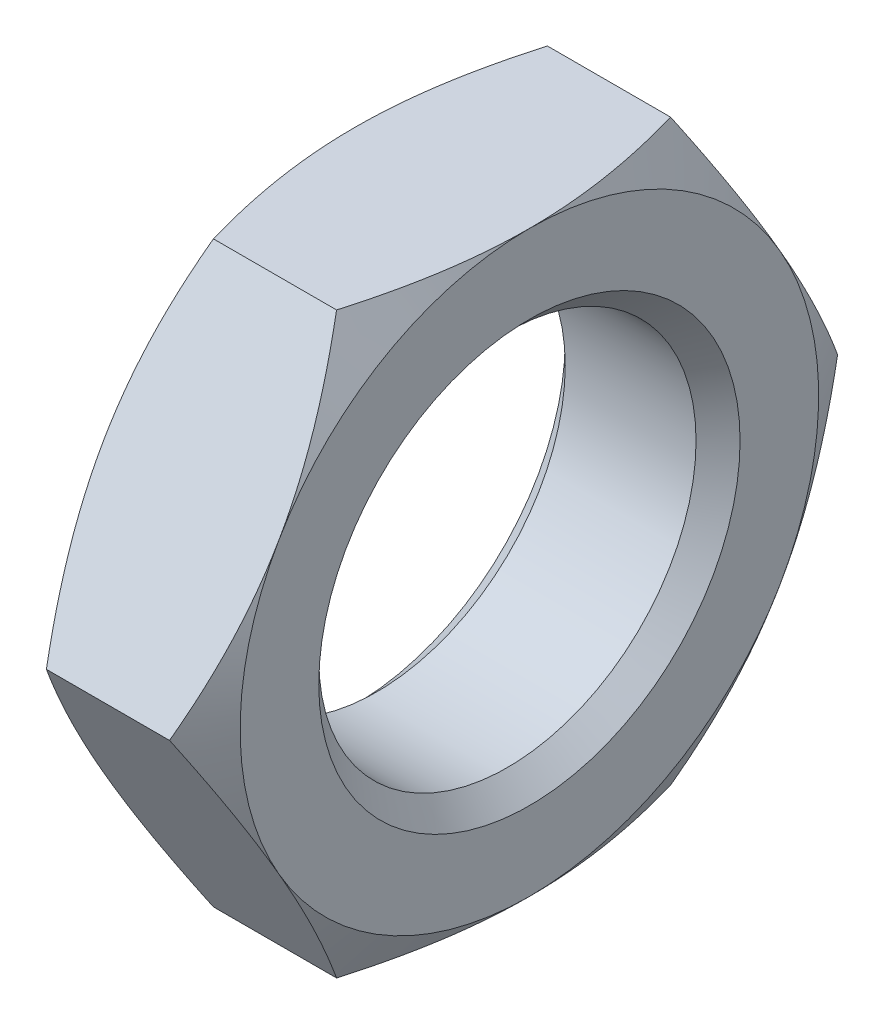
ISO-10303-21;
HEADER;
FILE_DESCRIPTION(('STEP AP214'),'2;1');
FILE_NAME('part.step','',(''),(''),'','','');
FILE_SCHEMA(('AUTOMOTIVE_DESIGN { 1 0 10303 214 1 1 1 1 }'));
ENDSEC;
DATA;
#1=APPLICATION_CONTEXT('core data for automotive mechanical design processes');
#2=APPLICATION_PROTOCOL_DEFINITION('international standard','automotive_design',2000,#1);
#3=PRODUCT_CONTEXT('',#1,'mechanical');
#4=PRODUCT('Part','Part','',(#3));
#5=PRODUCT_RELATED_PRODUCT_CATEGORY('part','',(#4));
#6=PRODUCT_DEFINITION_FORMATION('','',#4);
#7=PRODUCT_DEFINITION_CONTEXT('part definition',#1,'design');
#8=PRODUCT_DEFINITION('design','',#6,#7);
#9=PRODUCT_DEFINITION_SHAPE('','',#8);
#10=(LENGTH_UNIT() NAMED_UNIT(*) SI_UNIT(.MILLI.,.METRE.));
#11=(NAMED_UNIT(*) PLANE_ANGLE_UNIT() SI_UNIT($,.RADIAN.));
#12=(NAMED_UNIT(*) SI_UNIT($,.STERADIAN.) SOLID_ANGLE_UNIT());
#13=UNCERTAINTY_MEASURE_WITH_UNIT(LENGTH_MEASURE(1.E-05),#10,'distance_accuracy_value','');
#14=(GEOMETRIC_REPRESENTATION_CONTEXT(3) GLOBAL_UNCERTAINTY_ASSIGNED_CONTEXT((#13)) GLOBAL_UNIT_ASSIGNED_CONTEXT((#10,
#11,#12)) REPRESENTATION_CONTEXT('',''));
#15=CARTESIAN_POINT('',(0.,0.,0.));
#16=DIRECTION('',(0.,0.,1.));
#17=DIRECTION('',(1.,0.,0.));
#18=AXIS2_PLACEMENT_3D('',#15,#16,#17);
#19=CARTESIAN_POINT('',(13.9,23.,-13.2790561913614));
#20=DIRECTION('',(1.,0.,0.));
#21=DIRECTION('',(0.,0.,-1.));
#22=AXIS2_PLACEMENT_3D('',#19,#20,#21);
#23=PLANE('',#22);
#24=CARTESIAN_POINT('',(13.9,0.,0.));
#25=DIRECTION('',(1.,0.,0.));
#26=DIRECTION('',(0.,0.,-1.));
#27=AXIS2_PLACEMENT_3D('',#24,#25,#26);
#28=CIRCLE('',#27,16.75);
#29=CARTESIAN_POINT('',(13.9,0.,-16.75));
#30=VERTEX_POINT('',#29);
#31=EDGE_CURVE('E11',#30,#30,#28,.F.);
#32=ORIENTED_EDGE('',*,*,#31,.T.);
#33=EDGE_LOOP('',(#32));
#34=FACE_BOUND('',#33,.T.);
#35=CARTESIAN_POINT('',(13.9,0.,0.));
#36=DIRECTION('',(1.,0.,0.));
#37=DIRECTION('',(0.,0.,-1.));
#38=AXIS2_PLACEMENT_3D('',#35,#36,#37);
#39=CIRCLE('',#38,23.);
#40=CARTESIAN_POINT('',(13.9,-23.,0.));
#41=VERTEX_POINT('',#40);
#42=CARTESIAN_POINT('',(13.9,-11.5,-19.9185842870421));
#43=VERTEX_POINT('',#42);
#44=EDGE_CURVE('E142',#41,#43,#39,.T.);
#45=ORIENTED_EDGE('',*,*,#44,.T.);
#46=CARTESIAN_POINT('',(13.9,11.5,-19.9185842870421));
#47=VERTEX_POINT('',#46);
#48=EDGE_CURVE('E130',#43,#47,#39,.T.);
#49=ORIENTED_EDGE('',*,*,#48,.T.);
#50=CARTESIAN_POINT('',(13.9,23.,0.));
#51=VERTEX_POINT('',#50);
#52=EDGE_CURVE('E144',#47,#51,#39,.T.);
#53=ORIENTED_EDGE('',*,*,#52,.T.);
#54=CARTESIAN_POINT('',(13.9,11.5,19.9185842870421));
#55=VERTEX_POINT('',#54);
#56=EDGE_CURVE('E55',#51,#55,#39,.T.);
#57=ORIENTED_EDGE('',*,*,#56,.T.);
#58=CARTESIAN_POINT('',(13.9,-11.5,19.9185842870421));
#59=VERTEX_POINT('',#58);
#60=EDGE_CURVE('E63',#55,#59,#39,.T.);
#61=ORIENTED_EDGE('',*,*,#60,.T.);
#62=EDGE_CURVE('E166',#59,#41,#39,.T.);
#63=ORIENTED_EDGE('',*,*,#62,.T.);
#64=EDGE_LOOP('',(#45,#49,#53,#57,#61,#63));
#65=FACE_BOUND('',#64,.T.);
#66=ADVANCED_FACE('F39',(#34,#65),#23,.T.);
#67=CARTESIAN_POINT('',(0.,23.,-13.2790561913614));
#68=DIRECTION('',(1.,0.,0.));
#69=DIRECTION('',(0.,0.,-1.));
#70=AXIS2_PLACEMENT_3D('',#67,#68,#69);
#71=PLANE('',#70);
#72=CARTESIAN_POINT('',(0.,0.,0.));
#73=DIRECTION('',(1.,0.,0.));
#74=DIRECTION('',(0.,0.,-1.));
#75=AXIS2_PLACEMENT_3D('',#72,#73,#74);
#76=CIRCLE('',#75,16.75);
#77=CARTESIAN_POINT('',(0.,0.,16.75));
#78=VERTEX_POINT('',#77);
#79=EDGE_CURVE('E164',#78,#78,#76,.T.);
#80=ORIENTED_EDGE('',*,*,#79,.T.);
#81=EDGE_LOOP('',(#80));
#82=FACE_BOUND('',#81,.T.);
#83=CARTESIAN_POINT('',(0.,0.,0.));
#84=DIRECTION('',(1.,0.,0.));
#85=DIRECTION('',(0.,0.,-1.));
#86=AXIS2_PLACEMENT_3D('',#83,#84,#85);
#87=CIRCLE('',#86,23.);
#88=CARTESIAN_POINT('',(0.,-11.5,-19.9185842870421));
#89=VERTEX_POINT('',#88);
#90=CARTESIAN_POINT('',(0.,11.5,-19.9185842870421));
#91=VERTEX_POINT('',#90);
#92=EDGE_CURVE('E172',#89,#91,#87,.T.);
#93=ORIENTED_EDGE('',*,*,#92,.F.);
#94=CARTESIAN_POINT('',(0.,-23.,0.));
#95=VERTEX_POINT('',#94);
#96=EDGE_CURVE('E316',#95,#89,#87,.T.);
#97=ORIENTED_EDGE('',*,*,#96,.F.);
#98=CARTESIAN_POINT('',(0.,-11.5,19.9185842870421));
#99=VERTEX_POINT('',#98);
#100=EDGE_CURVE('E319',#99,#95,#87,.T.);
#101=ORIENTED_EDGE('',*,*,#100,.F.);
#102=CARTESIAN_POINT('',(0.,11.5,19.9185842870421));
#103=VERTEX_POINT('',#102);
#104=EDGE_CURVE('E325',#103,#99,#87,.T.);
#105=ORIENTED_EDGE('',*,*,#104,.F.);
#106=CARTESIAN_POINT('',(0.,23.,0.));
#107=VERTEX_POINT('',#106);
#108=EDGE_CURVE('E177',#107,#103,#87,.T.);
#109=ORIENTED_EDGE('',*,*,#108,.F.);
#110=EDGE_CURVE('E173',#91,#107,#87,.T.);
#111=ORIENTED_EDGE('',*,*,#110,.F.);
#112=EDGE_LOOP('',(#93,#97,#101,#105,#109,#111));
#113=FACE_BOUND('',#112,.T.);
#114=ADVANCED_FACE('F317',(#82,#113),#71,.F.);
#115=CARTESIAN_POINT('',(13.9,0.,0.));
#116=DIRECTION('',(-1.,0.,0.));
#117=DIRECTION('',(0.,0.,1.));
#118=AXIS2_PLACEMENT_3D('',#115,#116,#117);
#119=CYLINDRICAL_SURFACE('',#118,15.);
#120=CARTESIAN_POINT('',(1.75000000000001,0.,0.));
#121=DIRECTION('',(1.,0.,0.));
#122=DIRECTION('',(0.,0.,-1.));
#123=AXIS2_PLACEMENT_3D('',#120,#121,#122);
#124=CIRCLE('',#123,15.);
#125=CARTESIAN_POINT('',(1.75000000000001,0.,15.));
#126=VERTEX_POINT('',#125);
#127=EDGE_CURVE('E48',#126,#126,#124,.F.);
#128=ORIENTED_EDGE('',*,*,#127,.T.);
#129=EDGE_LOOP('',(#128));
#130=FACE_BOUND('',#129,.T.);
#131=CARTESIAN_POINT('',(12.15,0.,0.));
#132=DIRECTION('',(1.,0.,0.));
#133=DIRECTION('',(0.,0.,-1.));
#134=AXIS2_PLACEMENT_3D('',#131,#132,#133);
#135=CIRCLE('',#134,15.);
#136=CARTESIAN_POINT('',(12.15,0.,-15.));
#137=VERTEX_POINT('',#136);
#138=EDGE_CURVE('E408',#137,#137,#135,.T.);
#139=ORIENTED_EDGE('',*,*,#138,.T.);
#140=EDGE_LOOP('',(#139));
#141=FACE_BOUND('',#140,.T.);
#142=ADVANCED_FACE('F233',(#130,#141),#119,.F.);
#143=CARTESIAN_POINT('',(0.,0.,0.));
#144=DIRECTION('',(1.,0.,0.));
#145=DIRECTION('',(0.,0.,-1.));
#146=AXIS2_PLACEMENT_3D('',#143,#144,#145);
#147=CONICAL_SURFACE('',#146,23.,1.0471975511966);
#148=CARTESIAN_POINT('',(2.05434380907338,-23.0002,-13.2789407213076));
#149=CARTESIAN_POINT('',(1.88584599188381,-22.4946699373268,-13.5708086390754));
#150=CARTESIAN_POINT('',(1.72499439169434,-21.9871680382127,-13.8638149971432));
#151=CARTESIAN_POINT('',(1.42070899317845,-20.9680946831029,-14.4521772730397));
#152=CARTESIAN_POINT('',(1.27728092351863,-20.4565219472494,-14.7475339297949));
#153=CARTESIAN_POINT('',(1.00976772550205,-19.4283073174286,-15.3411739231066));
#154=CARTESIAN_POINT('',(0.885728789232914,-18.9116563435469,-15.6394625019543));
#155=CARTESIAN_POINT('',(0.659665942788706,-17.874786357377,-16.2380996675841));
#156=CARTESIAN_POINT('',(0.557639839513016,-17.3545677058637,-16.5384480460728));
#157=CARTESIAN_POINT('',(0.379933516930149,-16.3238595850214,-17.133527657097));
#158=CARTESIAN_POINT('',(0.303665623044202,-15.8134465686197,-17.4282147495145));
#159=CARTESIAN_POINT('',(0.175781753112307,-14.7902817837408,-18.0189392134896));
#160=CARTESIAN_POINT('',(0.124166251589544,-14.2775299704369,-18.3149766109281));
#161=CARTESIAN_POINT('',(0.0468904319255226,-13.2511650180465,-18.9075486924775));
#162=CARTESIAN_POINT('',(0.021199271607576,-12.737553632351,-19.2040823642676));
#163=CARTESIAN_POINT('',(-0.00367538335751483,-11.709856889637,-19.7974233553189));
#164=CARTESIAN_POINT('',(-0.00285969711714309,-11.1957715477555,-20.0942306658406));
#165=CARTESIAN_POINT('',(0.0234279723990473,-10.2346805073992,-20.649116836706));
#166=CARTESIAN_POINT('',(0.0456944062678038,-9.78760635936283,-20.9072352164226));
#167=CARTESIAN_POINT('',(0.109851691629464,-8.89452539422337,-21.422855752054));
#168=CARTESIAN_POINT('',(0.151742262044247,-8.44851856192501,-21.6803579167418));
#169=CARTESIAN_POINT('',(0.254421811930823,-7.5577370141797,-22.1946508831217));
#170=CARTESIAN_POINT('',(0.315227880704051,-7.11296378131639,-22.4514408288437));
#171=CARTESIAN_POINT('',(0.454662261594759,-6.22554696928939,-22.9637911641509));
#172=CARTESIAN_POINT('',(0.533290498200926,-5.78290338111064,-23.219351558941));
#173=CARTESIAN_POINT('',(0.797926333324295,-4.43913170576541,-23.9951784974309));
#174=CARTESIAN_POINT('',(1.01033549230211,-3.54182151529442,-24.513240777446));
#175=CARTESIAN_POINT('',(1.37195212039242,-2.20576568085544,-25.2846129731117));
#176=CARTESIAN_POINT('',(1.49952801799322,-1.76244815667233,-25.5405624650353));
#177=CARTESIAN_POINT('',(1.76759530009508,-0.878879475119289,-26.0506910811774));
#178=CARTESIAN_POINT('',(1.90808304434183,-0.438627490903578,-26.3048706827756));
#179=CARTESIAN_POINT('',(2.05434380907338,0.000200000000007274,-26.5582278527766));
#180=B_SPLINE_CURVE_WITH_KNOTS('',3,(#148,#149,#150,#151,#152,#153,#154,#155,#156,#157,#158,
#159,#160,#161,#162,#163,#164,#165,#166,#167,#168,#169,#170,#171,#172,#173,#174,#175,#176,#177,
#178,#179),.UNSPECIFIED.,.F.,.F.,(4,2,2,2,2,2,2,2,2,2,2,2,2,2,2,4),(0.,1.82275209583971,
3.64610187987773,5.47373144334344,7.30117883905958,9.08355891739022,10.8659733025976,
12.6462646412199,14.4265009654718,15.9762768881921,17.5260306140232,19.0771885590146,
20.6283399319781,23.7989683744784,25.381520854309,26.9636285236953),.UNSPECIFIED.);
#181=CARTESIAN_POINT('',(2.05427714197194,0.,-26.5581123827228));
#182=VERTEX_POINT('',#181);
#183=EDGE_CURVE('E332',#89,#182,#180,.T.);
#184=ORIENTED_EDGE('',*,*,#183,.F.);
#185=ORIENTED_EDGE('',*,*,#92,.T.);
#186=CARTESIAN_POINT('',(2.05434380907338,-0.000199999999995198,-26.5582278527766));
#187=CARTESIAN_POINT('',(1.88584599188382,0.505330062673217,-26.2663599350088));
#188=CARTESIAN_POINT('',(1.72499439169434,1.01283196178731,-25.973353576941));
#189=CARTESIAN_POINT('',(1.42070899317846,2.03190531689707,-25.3849913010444));
#190=CARTESIAN_POINT('',(1.27728092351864,2.54347805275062,-25.0896346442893));
#191=CARTESIAN_POINT('',(1.00976772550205,3.57169268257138,-24.4959946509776));
#192=CARTESIAN_POINT('',(0.885728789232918,4.08834365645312,-24.1977060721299));
#193=CARTESIAN_POINT('',(0.659665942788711,5.12521364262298,-23.5990689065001));
#194=CARTESIAN_POINT('',(0.55763983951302,5.64543229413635,-23.2987205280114));
#195=CARTESIAN_POINT('',(0.379933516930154,6.67614041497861,-22.7036409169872));
#196=CARTESIAN_POINT('',(0.303665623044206,7.18655343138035,-22.4089538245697));
#197=CARTESIAN_POINT('',(0.175781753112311,8.20971821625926,-21.8182293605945));
#198=CARTESIAN_POINT('',(0.124166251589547,8.72247002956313,-21.5221919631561));
#199=CARTESIAN_POINT('',(0.0468904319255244,9.74883498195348,-20.9296198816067));
#200=CARTESIAN_POINT('',(0.0211992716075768,10.262446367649,-20.6330862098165));
#201=CARTESIAN_POINT('',(-0.0036753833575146,11.290143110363,-20.0397452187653));
#202=CARTESIAN_POINT('',(-0.00285969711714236,11.8042284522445,-19.7429379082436));
#203=CARTESIAN_POINT('',(0.0234279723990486,12.7653194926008,-19.1880517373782));
#204=CARTESIAN_POINT('',(0.0456944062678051,13.2123936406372,-18.9299333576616));
#205=CARTESIAN_POINT('',(0.109851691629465,14.1054746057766,-18.4143128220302));
#206=CARTESIAN_POINT('',(0.151742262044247,14.551481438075,-18.1568106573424));
#207=CARTESIAN_POINT('',(0.254421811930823,15.4422629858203,-17.6425176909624));
#208=CARTESIAN_POINT('',(0.31522788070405,15.8870362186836,-17.3857277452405));
#209=CARTESIAN_POINT('',(0.454662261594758,16.7744530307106,-16.8733774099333));
#210=CARTESIAN_POINT('',(0.533290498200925,17.2170966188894,-16.6178170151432));
#211=CARTESIAN_POINT('',(0.797926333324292,18.5608682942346,-15.8419900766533));
#212=CARTESIAN_POINT('',(1.01033549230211,19.4581784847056,-15.3239277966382));
#213=CARTESIAN_POINT('',(1.37195212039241,20.7942343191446,-14.5525556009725));
#214=CARTESIAN_POINT('',(1.49952801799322,21.2375518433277,-14.2966061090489));
#215=CARTESIAN_POINT('',(1.76759530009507,22.1211205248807,-13.7864774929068));
#216=CARTESIAN_POINT('',(1.90808304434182,22.5613725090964,-13.5322978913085));
#217=CARTESIAN_POINT('',(2.05434380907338,23.0002,-13.2789407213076));
#218=B_SPLINE_CURVE_WITH_KNOTS('',3,(#186,#187,#188,#189,#190,#191,#192,#193,#194,#195,#196,
#197,#198,#199,#200,#201,#202,#203,#204,#205,#206,#207,#208,#209,#210,#211,#212,#213,#214,#215,
#216,#217),.UNSPECIFIED.,.F.,.F.,(4,2,2,2,2,2,2,2,2,2,2,2,2,2,2,4),(0.,1.82275209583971,
3.64610187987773,5.47373144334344,7.30117883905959,9.08355891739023,10.8659733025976,
12.6462646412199,14.4265009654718,15.9762768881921,17.5260306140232,19.0771885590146,
20.6283399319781,23.7989683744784,25.381520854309,26.9636285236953),.UNSPECIFIED.);
#219=EDGE_CURVE('E214',#182,#91,#218,.T.);
#220=ORIENTED_EDGE('',*,*,#219,.F.);
#221=EDGE_LOOP('',(#184,#185,#220));
#222=FACE_BOUND('',#221,.T.);
#223=ADVANCED_FACE('F193',(#222),#147,.T.);
#224=ORIENTED_EDGE('',*,*,#96,.T.);
#225=CARTESIAN_POINT('',(2.05427714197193,-23.,-13.2790561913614));
#226=VERTEX_POINT('',#225);
#227=EDGE_CURVE('E156',#226,#89,#180,.T.);
#228=ORIENTED_EDGE('',*,*,#227,.F.);
#229=CARTESIAN_POINT('',(11.3375044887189,-23.,-35.901604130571));
#230=CARTESIAN_POINT('',(11.0928657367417,-23.,-35.3983673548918));
#231=CARTESIAN_POINT('',(10.8494259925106,-23.,-34.8945459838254));
#232=CARTESIAN_POINT('',(10.3652232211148,-23.,-33.8856128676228));
#233=CARTESIAN_POINT('',(10.1244602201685,-23.,-33.380501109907));
#234=CARTESIAN_POINT('',(9.64585834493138,-23.,-32.3687995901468));
#235=CARTESIAN_POINT('',(9.40801991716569,-23.,-31.8622096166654));
#236=CARTESIAN_POINT('',(8.93563947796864,-23.,-30.8474971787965));
#237=CARTESIAN_POINT('',(8.70109745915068,-23.,-30.339374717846));
#238=CARTESIAN_POINT('',(8.00048014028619,-23.,-28.8070685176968));
#239=CARTESIAN_POINT('',(7.53996977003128,-23.,-27.7803298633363));
#240=CARTESIAN_POINT('',(6.63745975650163,-23.,-25.7187647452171));
#241=CARTESIAN_POINT('',(6.19545925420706,-23.,-24.6839386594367));
#242=CARTESIAN_POINT('',(5.54295986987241,-23.,-23.1072404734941));
#243=CARTESIAN_POINT('',(5.32385304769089,-23.,-22.5689274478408));
#244=CARTESIAN_POINT('',(4.89276121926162,-23.,-21.4894606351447));
#245=CARTESIAN_POINT('',(4.68077610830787,-23.,-20.9483068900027));
#246=CARTESIAN_POINT('',(4.26485785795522,-23.,-19.8628192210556));
#247=CARTESIAN_POINT('',(4.06092587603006,-23.,-19.3184848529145));
#248=CARTESIAN_POINT('',(3.66226499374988,-23.,-18.2264649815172));
#249=CARTESIAN_POINT('',(3.46753589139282,-23.,-17.6787795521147));
#250=CARTESIAN_POINT('',(3.08892062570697,-23.,-16.5808763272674));
#251=CARTESIAN_POINT('',(2.9050136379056,-23.,-16.0306657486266));
#252=CARTESIAN_POINT('',(2.54906824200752,-23.,-14.9264294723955));
#253=CARTESIAN_POINT('',(2.37703003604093,-23.,-14.3724037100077));
#254=CARTESIAN_POINT('',(1.88116548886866,-23.,-12.704562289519));
#255=CARTESIAN_POINT('',(1.57744413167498,-23.,-11.5845688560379));
#256=CARTESIAN_POINT('',(1.17388340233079,-23.,-9.89559009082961));
#257=CARTESIAN_POINT('',(1.04831343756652,-23.,-9.33269040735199));
#258=CARTESIAN_POINT('',(0.815985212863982,-23.,-8.20299739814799));
#259=CARTESIAN_POINT('',(0.709226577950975,-23.,-7.63620415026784));
#260=CARTESIAN_POINT('',(0.516392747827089,-23.,-6.49911483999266));
#261=CARTESIAN_POINT('',(0.430316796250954,-23.,-5.92881890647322));
#262=CARTESIAN_POINT('',(0.280550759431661,-23.,-4.78527464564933));
#263=CARTESIAN_POINT('',(0.216860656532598,-23.,-4.2120263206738));
#264=CARTESIAN_POINT('',(0.113948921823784,-23.,-3.07099713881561));
#265=CARTESIAN_POINT('',(0.0744136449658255,-23.,-2.50324474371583));
#266=CARTESIAN_POINT('',(0.0194002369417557,-23.,-1.36657706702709));
#267=CARTESIAN_POINT('',(0.00392170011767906,-23.,-0.79766180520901));
#268=CARTESIAN_POINT('',(-0.00260909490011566,-23.,0.340313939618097));
#269=CARTESIAN_POINT('',(0.00633868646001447,-23.,0.909374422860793));
#270=CARTESIAN_POINT('',(0.0484394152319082,-23.,2.04660592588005));
#271=CARTESIAN_POINT('',(0.0815934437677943,-23.,2.61477690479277));
#272=CARTESIAN_POINT('',(0.189095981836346,-23.,3.9732958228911));
#273=CARTESIAN_POINT('',(0.274541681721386,-23.,4.76278154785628));
#274=CARTESIAN_POINT('',(0.487570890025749,-23.,6.33605059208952));
#275=CARTESIAN_POINT('',(0.615159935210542,-23.,7.11983314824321));
#276=CARTESIAN_POINT('',(0.907937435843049,-23.,8.68089545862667));
#277=CARTESIAN_POINT('',(1.07315451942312,-23.,9.4581697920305));
#278=CARTESIAN_POINT('',(1.43613331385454,-23.,11.0049987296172));
#279=CARTESIAN_POINT('',(1.63389458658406,-23.,11.7745534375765));
#280=CARTESIAN_POINT('',(2.06184724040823,-23.,13.3230024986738));
#281=CARTESIAN_POINT('',(2.29266280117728,-23.,14.1017231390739));
#282=CARTESIAN_POINT('',(2.77861036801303,-23.,15.6514967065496));
#283=CARTESIAN_POINT('',(3.03374253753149,-23.,16.4225495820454));
#284=CARTESIAN_POINT('',(3.56423157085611,-23.,17.957360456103));
#285=CARTESIAN_POINT('',(3.83958202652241,-23.,18.7211206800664));
#286=CARTESIAN_POINT('',(4.40722241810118,-23.,20.2422814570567));
#287=CARTESIAN_POINT('',(4.69951213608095,-23.,20.9996820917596));
#288=CARTESIAN_POINT('',(5.41931366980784,-23.,22.8140495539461));
#289=CARTESIAN_POINT('',(5.85370436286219,-23.,23.8682835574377));
#290=CARTESIAN_POINT('',(6.74431233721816,-23.,25.9675201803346));
#291=CARTESIAN_POINT('',(7.20053109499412,-23.,27.0125221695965));
#292=CARTESIAN_POINT('',(8.13033772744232,-23.,29.0950552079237));
#293=CARTESIAN_POINT('',(8.60392982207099,-23.,30.13258436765));
#294=CARTESIAN_POINT('',(9.56490487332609,-23.,32.2011896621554));
#295=CARTESIAN_POINT('',(10.0522875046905,-23.,33.2322659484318));
#296=CARTESIAN_POINT('',(11.0387920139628,-23.,35.2902593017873));
#297=CARTESIAN_POINT('',(11.5379269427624,-23.,36.3171701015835));
#298=CARTESIAN_POINT('',(12.5453457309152,-23.,38.3664937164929));
#299=CARTESIAN_POINT('',(13.0536296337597,-23.,39.3889065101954));
#300=CARTESIAN_POINT('',(14.0776818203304,-23.,41.4297961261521));
#301=CARTESIAN_POINT('',(14.593449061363,-23.,42.4482734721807));
#302=CARTESIAN_POINT('',(15.6312820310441,-23.,44.4820085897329));
#303=CARTESIAN_POINT('',(16.1533477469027,-23.,45.4972663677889));
#304=CARTESIAN_POINT('',(17.1573900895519,-23.,47.4373299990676));
#305=CARTESIAN_POINT('',(17.6389279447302,-23.,48.3623631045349));
#306=CARTESIAN_POINT('',(18.6058166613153,-23.,50.2104350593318));
#307=CARTESIAN_POINT('',(19.0911675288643,-23.,51.1334739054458));
#308=CARTESIAN_POINT('',(20.5521837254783,-23.,53.9000546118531));
#309=CARTESIAN_POINT('',(21.5327783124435,-23.,55.7409944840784));
#310=CARTESIAN_POINT('',(23.0098819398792,-23.,58.4959458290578));
#311=CARTESIAN_POINT('',(23.5026294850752,-23.,59.4119795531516));
#312=CARTESIAN_POINT('',(24.4903350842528,-23.,61.2428555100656));
#313=CARTESIAN_POINT('',(24.9852931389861,-23.,62.1576977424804));
#314=CARTESIAN_POINT('',(25.9771308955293,-23.,63.986270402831));
#315=CARTESIAN_POINT('',(26.4740104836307,-23.,64.9000008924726));
#316=CARTESIAN_POINT('',(27.4695101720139,-23.,66.7265115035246));
#317=CARTESIAN_POINT('',(27.9681302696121,-23.,67.6392916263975));
#318=CARTESIAN_POINT('',(28.4675164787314,-23.,68.5516519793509));
#319=B_SPLINE_CURVE_WITH_KNOTS('',3,(#229,#230,#231,#232,#233,#234,#235,#236,#237,#238,#239,
#240,#241,#242,#243,#244,#245,#246,#247,#248,#249,#250,#251,#252,#253,#254,#255,#256,#257,#258,
#259,#260,#261,#262,#263,#264,#265,#266,#267,#268,#269,#270,#271,#272,#273,#274,#275,#276,#277,
#278,#279,#280,#281,#282,#283,#284,#285,#286,#287,#288,#289,#290,#291,#292,#293,#294,#295,#296,
#297,#298,#299,#300,#301,#302,#303,#304,#305,#306,#307,#308,#309,#310,#311,#312,#313,#314,#315,
#316,#317,#318),.UNSPECIFIED.,.F.,.F.,(4,2,2,2,2,2,2,2,2,2,2,2,2,2,2,2,2,2,2,2,2,2,2,2,2,2,2,2,
2,2,2,2,2,2,2,2,2,2,2,2,2,2,2,2,4),(0.,1.67864838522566,3.35731319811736,5.03623120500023,
6.71514544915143,10.090852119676,13.4664019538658,15.2099485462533,16.9534694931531,
18.6972401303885,20.4409724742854,22.1812316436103,23.9215204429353,27.4007840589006,
29.1307380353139,30.8606575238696,32.5905137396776,34.3203685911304,36.0272558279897,
37.7341142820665,39.4409755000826,41.1479129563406,43.528889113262,45.9101782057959,
48.2932851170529,50.676359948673,53.1125100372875,55.548676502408,57.9840741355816,
60.4194404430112,63.8397667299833,67.2603246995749,70.6817190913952,74.1030328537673,
77.5283441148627,80.9536716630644,84.3785264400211,87.8033742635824,90.9319555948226,
94.0605419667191,100.317938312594,103.438395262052,106.558853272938,109.679129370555,
112.799400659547),.UNSPECIFIED.);
#320=EDGE_CURVE('E176',#95,#226,#319,.F.);
#321=ORIENTED_EDGE('',*,*,#320,.F.);
#322=EDGE_LOOP('',(#224,#228,#321));
#323=FACE_BOUND('',#322,.T.);
#324=ADVANCED_FACE('F351',(#323),#147,.T.);
#325=CARTESIAN_POINT('',(6.95,0.,0.));
#326=DIRECTION('',(-1.,0.,0.));
#327=DIRECTION('',(0.,0.,1.));
#328=AXIS2_PLACEMENT_3D('',#325,#326,#327);
#329=CONICAL_SURFACE('',#328,35.0377531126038,1.0471975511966);
#330=CARTESIAN_POINT('',(11.8456561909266,0.000200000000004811,-26.5582278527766));
#331=CARTESIAN_POINT('',(12.0141540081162,-0.505330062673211,-26.2663599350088));
#332=CARTESIAN_POINT('',(12.1750056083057,-1.0128319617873,-25.973353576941));
#333=CARTESIAN_POINT('',(12.4792910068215,-2.03190531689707,-25.3849913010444));
#334=CARTESIAN_POINT('',(12.6227190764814,-2.54347805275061,-25.0896346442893));
#335=CARTESIAN_POINT('',(12.8902322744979,-3.57169268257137,-24.4959946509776));
#336=CARTESIAN_POINT('',(13.0142712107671,-4.08834365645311,-24.1977060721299));
#337=CARTESIAN_POINT('',(13.2403340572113,-5.12521364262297,-23.5990689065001));
#338=CARTESIAN_POINT('',(13.342360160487,-5.64543229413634,-23.2987205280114));
#339=CARTESIAN_POINT('',(13.5200664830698,-6.6761404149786,-22.7036409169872));
#340=CARTESIAN_POINT('',(13.5963343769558,-7.18655343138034,-22.4089538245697));
#341=CARTESIAN_POINT('',(13.7242182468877,-8.20971821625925,-21.8182293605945));
#342=CARTESIAN_POINT('',(13.7758337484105,-8.72247002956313,-21.5221919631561));
#343=CARTESIAN_POINT('',(13.8531095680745,-9.74883498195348,-20.9296198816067));
#344=CARTESIAN_POINT('',(13.8788007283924,-10.262446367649,-20.6330862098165));
#345=CARTESIAN_POINT('',(13.9036753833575,-11.290143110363,-20.0397452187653));
#346=CARTESIAN_POINT('',(13.9028596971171,-11.8042284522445,-19.7429379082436));
#347=CARTESIAN_POINT('',(13.876572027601,-12.7653194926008,-19.1880517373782));
#348=CARTESIAN_POINT('',(13.8543055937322,-13.2123936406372,-18.9299333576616));
#349=CARTESIAN_POINT('',(13.7901483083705,-14.1054746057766,-18.4143128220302));
#350=CARTESIAN_POINT('',(13.7482577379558,-14.551481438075,-18.1568106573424));
#351=CARTESIAN_POINT('',(13.6455781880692,-15.4422629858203,-17.6425176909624));
#352=CARTESIAN_POINT('',(13.584772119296,-15.8870362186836,-17.3857277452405));
#353=CARTESIAN_POINT('',(13.4453377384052,-16.7744530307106,-16.8733774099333));
#354=CARTESIAN_POINT('',(13.3667095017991,-17.2170966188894,-16.6178170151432));
#355=CARTESIAN_POINT('',(13.1020736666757,-18.5608682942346,-15.8419900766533));
#356=CARTESIAN_POINT('',(12.8896645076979,-19.4581784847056,-15.3239277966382));
#357=CARTESIAN_POINT('',(12.5280478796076,-20.7942343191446,-14.5525556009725));
#358=CARTESIAN_POINT('',(12.4004719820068,-21.2375518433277,-14.2966061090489));
#359=CARTESIAN_POINT('',(12.1324046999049,-22.1211205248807,-13.7864774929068));
#360=CARTESIAN_POINT('',(11.9919169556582,-22.5613725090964,-13.5322978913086));
#361=CARTESIAN_POINT('',(11.8456561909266,-23.0002,-13.2789407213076));
#362=B_SPLINE_CURVE_WITH_KNOTS('',3,(#330,#331,#332,#333,#334,#335,#336,#337,#338,#339,#340,
#341,#342,#343,#344,#345,#346,#347,#348,#349,#350,#351,#352,#353,#354,#355,#356,#357,#358,#359,
#360,#361),.UNSPECIFIED.,.F.,.F.,(4,2,2,2,2,2,2,2,2,2,2,2,2,2,2,4),(0.,1.82275209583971,
3.64610187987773,5.47373144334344,7.30117883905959,9.08355891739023,10.8659733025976,
12.6462646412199,14.4265009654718,15.9762768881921,17.5260306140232,19.0771885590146,
20.6283399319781,23.7989683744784,25.381520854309,26.9636285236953),.UNSPECIFIED.);
#363=CARTESIAN_POINT('',(11.8457228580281,-23.,-13.2790561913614));
#364=VERTEX_POINT('',#363);
#365=EDGE_CURVE('E147',#43,#364,#362,.T.);
#366=ORIENTED_EDGE('',*,*,#365,.F.);
#367=ORIENTED_EDGE('',*,*,#44,.F.);
#368=CARTESIAN_POINT('',(2.5624955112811,-23.,-35.901604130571));
#369=CARTESIAN_POINT('',(2.80713426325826,-23.,-35.3983673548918));
#370=CARTESIAN_POINT('',(3.05057400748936,-23.,-34.8945459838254));
#371=CARTESIAN_POINT('',(3.53477677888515,-23.,-33.8856128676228));
#372=CARTESIAN_POINT('',(3.77553977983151,-23.,-33.380501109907));
#373=CARTESIAN_POINT('',(4.25414165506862,-23.,-32.3687995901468));
#374=CARTESIAN_POINT('',(4.49198008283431,-23.,-31.8622096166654));
#375=CARTESIAN_POINT('',(4.96436052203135,-23.,-30.8474971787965));
#376=CARTESIAN_POINT('',(5.19890254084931,-23.,-30.339374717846));
#377=CARTESIAN_POINT('',(5.89951985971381,-23.,-28.8070685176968));
#378=CARTESIAN_POINT('',(6.36003022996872,-23.,-27.7803298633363));
#379=CARTESIAN_POINT('',(7.26254024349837,-23.,-25.7187647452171));
#380=CARTESIAN_POINT('',(7.70454074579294,-23.,-24.6839386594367));
#381=CARTESIAN_POINT('',(8.35704013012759,-23.,-23.1072404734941));
#382=CARTESIAN_POINT('',(8.57614695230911,-23.,-22.5689274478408));
#383=CARTESIAN_POINT('',(9.00723878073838,-23.,-21.4894606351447));
#384=CARTESIAN_POINT('',(9.21922389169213,-23.,-20.9483068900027));
#385=CARTESIAN_POINT('',(9.63514214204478,-23.,-19.8628192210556));
#386=CARTESIAN_POINT('',(9.83907412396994,-23.,-19.3184848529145));
#387=CARTESIAN_POINT('',(10.2377350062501,-23.,-18.2264649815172));
#388=CARTESIAN_POINT('',(10.4324641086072,-23.,-17.6787795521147));
#389=CARTESIAN_POINT('',(10.811079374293,-23.,-16.5808763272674));
#390=CARTESIAN_POINT('',(10.9949863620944,-23.,-16.0306657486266));
#391=CARTESIAN_POINT('',(11.3509317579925,-23.,-14.9264294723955));
#392=CARTESIAN_POINT('',(11.5229699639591,-23.,-14.3724037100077));
#393=CARTESIAN_POINT('',(12.0188345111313,-23.,-12.704562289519));
#394=CARTESIAN_POINT('',(12.322555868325,-23.,-11.5845688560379));
#395=CARTESIAN_POINT('',(12.7261165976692,-23.,-9.89559009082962));
#396=CARTESIAN_POINT('',(12.8516865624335,-23.,-9.332690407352));
#397=CARTESIAN_POINT('',(13.084014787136,-23.,-8.20299739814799));
#398=CARTESIAN_POINT('',(13.190773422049,-23.,-7.63620415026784));
#399=CARTESIAN_POINT('',(13.3836072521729,-23.,-6.49911483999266));
#400=CARTESIAN_POINT('',(13.469683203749,-23.,-5.92881890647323));
#401=CARTESIAN_POINT('',(13.6194492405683,-23.,-4.78527464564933));
#402=CARTESIAN_POINT('',(13.6831393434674,-23.,-4.21202632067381));
#403=CARTESIAN_POINT('',(13.7860510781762,-23.,-3.07099713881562));
#404=CARTESIAN_POINT('',(13.8255863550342,-23.,-2.50324474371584));
#405=CARTESIAN_POINT('',(13.8805997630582,-23.,-1.36657706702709));
#406=CARTESIAN_POINT('',(13.8960782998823,-23.,-0.797661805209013));
#407=CARTESIAN_POINT('',(13.9026090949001,-23.,0.340313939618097));
#408=CARTESIAN_POINT('',(13.89366131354,-23.,0.909374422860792));
#409=CARTESIAN_POINT('',(13.8515605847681,-23.,2.04660592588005));
#410=CARTESIAN_POINT('',(13.8184065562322,-23.,2.61477690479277));
#411=CARTESIAN_POINT('',(13.7109040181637,-23.,3.9732958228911));
#412=CARTESIAN_POINT('',(13.6254583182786,-23.,4.76278154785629));
#413=CARTESIAN_POINT('',(13.4124291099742,-23.,6.33605059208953));
#414=CARTESIAN_POINT('',(13.2848400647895,-23.,7.11983314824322));
#415=CARTESIAN_POINT('',(12.992062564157,-23.,8.68089545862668));
#416=CARTESIAN_POINT('',(12.8268454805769,-23.,9.4581697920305));
#417=CARTESIAN_POINT('',(12.4638666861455,-23.,11.0049987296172));
#418=CARTESIAN_POINT('',(12.2661054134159,-23.,11.7745534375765));
#419=CARTESIAN_POINT('',(11.8381527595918,-23.,13.3230024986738));
#420=CARTESIAN_POINT('',(11.6073371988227,-23.,14.1017231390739));
#421=CARTESIAN_POINT('',(11.121389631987,-23.,15.6514967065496));
#422=CARTESIAN_POINT('',(10.8662574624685,-23.,16.4225495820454));
#423=CARTESIAN_POINT('',(10.3357684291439,-23.,17.957360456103));
#424=CARTESIAN_POINT('',(10.0604179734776,-23.,18.7211206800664));
#425=CARTESIAN_POINT('',(9.49277758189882,-23.,20.2422814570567));
#426=CARTESIAN_POINT('',(9.20048786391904,-23.,20.9996820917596));
#427=CARTESIAN_POINT('',(8.48068633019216,-23.,22.8140495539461));
#428=CARTESIAN_POINT('',(8.0462956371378,-23.,23.8682835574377));
#429=CARTESIAN_POINT('',(7.15568766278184,-23.,25.9675201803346));
#430=CARTESIAN_POINT('',(6.69946890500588,-23.,27.0125221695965));
#431=CARTESIAN_POINT('',(5.76966227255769,-23.,29.0950552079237));
#432=CARTESIAN_POINT('',(5.29607017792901,-23.,30.13258436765));
#433=CARTESIAN_POINT('',(4.33509512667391,-23.,32.2011896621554));
#434=CARTESIAN_POINT('',(3.84771249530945,-23.,33.2322659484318));
#435=CARTESIAN_POINT('',(2.8612079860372,-23.,35.2902593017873));
#436=CARTESIAN_POINT('',(2.36207305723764,-23.,36.3171701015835));
#437=CARTESIAN_POINT('',(1.35465426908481,-23.,38.3664937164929));
#438=CARTESIAN_POINT('',(0.846370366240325,-23.,39.3889065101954));
#439=CARTESIAN_POINT('',(-0.177681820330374,-23.,41.4297961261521));
#440=CARTESIAN_POINT('',(-0.693449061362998,-23.,42.4482734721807));
#441=CARTESIAN_POINT('',(-1.73128203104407,-23.,44.4820085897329));
#442=CARTESIAN_POINT('',(-2.25334774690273,-23.,45.4972663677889));
#443=CARTESIAN_POINT('',(-3.25739008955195,-23.,47.4373299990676));
#444=CARTESIAN_POINT('',(-3.73892794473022,-23.,48.3623631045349));
#445=CARTESIAN_POINT('',(-4.70581666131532,-23.,50.2104350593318));
#446=CARTESIAN_POINT('',(-5.19116752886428,-23.,51.1334739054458));
#447=CARTESIAN_POINT('',(-6.65218372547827,-23.,53.9000546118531));
#448=CARTESIAN_POINT('',(-7.6327783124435,-23.,55.7409944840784));
#449=CARTESIAN_POINT('',(-9.10988193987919,-23.,58.4959458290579));
#450=CARTESIAN_POINT('',(-9.60262948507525,-23.,59.4119795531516));
#451=CARTESIAN_POINT('',(-10.5903350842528,-23.,61.2428555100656));
#452=CARTESIAN_POINT('',(-11.0852931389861,-23.,62.1576977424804));
#453=CARTESIAN_POINT('',(-12.0771308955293,-23.,63.9862704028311));
#454=CARTESIAN_POINT('',(-12.5740104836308,-23.,64.9000008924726));
#455=CARTESIAN_POINT('',(-13.5695101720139,-23.,66.7265115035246));
#456=CARTESIAN_POINT('',(-14.0681302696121,-23.,67.6392916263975));
#457=CARTESIAN_POINT('',(-14.5675164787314,-23.,68.5516519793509));
#458=B_SPLINE_CURVE_WITH_KNOTS('',3,(#368,#369,#370,#371,#372,#373,#374,#375,#376,#377,#378,
#379,#380,#381,#382,#383,#384,#385,#386,#387,#388,#389,#390,#391,#392,#393,#394,#395,#396,#397,
#398,#399,#400,#401,#402,#403,#404,#405,#406,#407,#408,#409,#410,#411,#412,#413,#414,#415,#416,
#417,#418,#419,#420,#421,#422,#423,#424,#425,#426,#427,#428,#429,#430,#431,#432,#433,#434,#435,
#436,#437,#438,#439,#440,#441,#442,#443,#444,#445,#446,#447,#448,#449,#450,#451,#452,#453,#454,
#455,#456,#457),.UNSPECIFIED.,.F.,.F.,(4,2,2,2,2,2,2,2,2,2,2,2,2,2,2,2,2,2,2,2,2,2,2,2,2,2,2,2,
2,2,2,2,2,2,2,2,2,2,2,2,2,2,2,2,4),(0.,1.67864838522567,3.35731319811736,5.03623120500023,
6.71514544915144,10.090852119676,13.4664019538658,15.2099485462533,16.9534694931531,
18.6972401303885,20.4409724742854,22.1812316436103,23.9215204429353,27.4007840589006,
29.1307380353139,30.8606575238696,32.5905137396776,34.3203685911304,36.0272558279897,
37.7341142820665,39.4409755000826,41.1479129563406,43.5288891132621,45.910178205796,
48.2932851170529,50.676359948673,53.1125100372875,55.548676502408,57.9840741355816,
60.4194404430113,63.8397667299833,67.2603246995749,70.6817190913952,74.1030328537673,
77.5283441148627,80.9536716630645,84.3785264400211,87.8033742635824,90.9319555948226,
94.0605419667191,100.317938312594,103.438395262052,106.558853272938,109.679129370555,
112.799400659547),.UNSPECIFIED.);
#459=EDGE_CURVE('E151',#364,#41,#458,.T.);
#460=ORIENTED_EDGE('',*,*,#459,.F.);
#461=EDGE_LOOP('',(#366,#367,#460));
#462=FACE_BOUND('',#461,.T.);
#463=ADVANCED_FACE('F148',(#462),#329,.T.);
#464=ORIENTED_EDGE('',*,*,#48,.F.);
#465=CARTESIAN_POINT('',(11.8457228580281,0.,-26.5581123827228));
#466=VERTEX_POINT('',#465);
#467=EDGE_CURVE('E134',#466,#43,#362,.T.);
#468=ORIENTED_EDGE('',*,*,#467,.F.);
#469=CARTESIAN_POINT('',(11.8456561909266,23.0002,-13.2789407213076));
#470=CARTESIAN_POINT('',(12.0141540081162,22.4946699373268,-13.5708086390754));
#471=CARTESIAN_POINT('',(12.1750056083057,21.9871680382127,-13.8638149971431));
#472=CARTESIAN_POINT('',(12.4792910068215,20.9680946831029,-14.4521772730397));
#473=CARTESIAN_POINT('',(12.6227190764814,20.4565219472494,-14.7475339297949));
#474=CARTESIAN_POINT('',(12.890232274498,19.4283073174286,-15.3411739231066));
#475=CARTESIAN_POINT('',(13.0142712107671,18.9116563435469,-15.6394625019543));
#476=CARTESIAN_POINT('',(13.2403340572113,17.874786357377,-16.2380996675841));
#477=CARTESIAN_POINT('',(13.342360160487,17.3545677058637,-16.5384480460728));
#478=CARTESIAN_POINT('',(13.5200664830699,16.3238595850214,-17.133527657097));
#479=CARTESIAN_POINT('',(13.5963343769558,15.8134465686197,-17.4282147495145));
#480=CARTESIAN_POINT('',(13.7242182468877,14.7902817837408,-18.0189392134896));
#481=CARTESIAN_POINT('',(13.7758337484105,14.2775299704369,-18.3149766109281));
#482=CARTESIAN_POINT('',(13.8531095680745,13.2511650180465,-18.9075486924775));
#483=CARTESIAN_POINT('',(13.8788007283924,12.737553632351,-19.2040823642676));
#484=CARTESIAN_POINT('',(13.9036753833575,11.709856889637,-19.7974233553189));
#485=CARTESIAN_POINT('',(13.9028596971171,11.1957715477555,-20.0942306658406));
#486=CARTESIAN_POINT('',(13.876572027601,10.2346805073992,-20.649116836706));
#487=CARTESIAN_POINT('',(13.8543055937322,9.78760635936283,-20.9072352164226));
#488=CARTESIAN_POINT('',(13.7901483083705,8.89452539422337,-21.422855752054));
#489=CARTESIAN_POINT('',(13.7482577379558,8.44851856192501,-21.6803579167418));
#490=CARTESIAN_POINT('',(13.6455781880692,7.5577370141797,-22.1946508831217));
#491=CARTESIAN_POINT('',(13.5847721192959,7.1129637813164,-22.4514408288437));
#492=CARTESIAN_POINT('',(13.4453377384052,6.22554696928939,-22.9637911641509));
#493=CARTESIAN_POINT('',(13.3667095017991,5.78290338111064,-23.219351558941));
#494=CARTESIAN_POINT('',(13.1020736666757,4.43913170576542,-23.9951784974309));
#495=CARTESIAN_POINT('',(12.8896645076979,3.54182151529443,-24.513240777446));
#496=CARTESIAN_POINT('',(12.5280478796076,2.20576568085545,-25.2846129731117));
#497=CARTESIAN_POINT('',(12.4004719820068,1.76244815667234,-25.5405624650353));
#498=CARTESIAN_POINT('',(12.1324046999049,0.878879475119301,-26.0506910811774));
#499=CARTESIAN_POINT('',(11.9919169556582,0.438627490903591,-26.3048706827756));
#500=CARTESIAN_POINT('',(11.8456561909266,-0.000199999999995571,-26.5582278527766));
#501=B_SPLINE_CURVE_WITH_KNOTS('',3,(#469,#470,#471,#472,#473,#474,#475,#476,#477,#478,#479,
#480,#481,#482,#483,#484,#485,#486,#487,#488,#489,#490,#491,#492,#493,#494,#495,#496,#497,#498,
#499,#500),.UNSPECIFIED.,.F.,.F.,(4,2,2,2,2,2,2,2,2,2,2,2,2,2,2,4),(0.,1.82275209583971,
3.64610187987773,5.47373144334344,7.30117883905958,9.08355891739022,10.8659733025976,
12.6462646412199,14.4265009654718,15.9762768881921,17.5260306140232,19.0771885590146,
20.6283399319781,23.7989683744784,25.381520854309,26.9636285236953),.UNSPECIFIED.);
#502=EDGE_CURVE('E136',#47,#466,#501,.T.);
#503=ORIENTED_EDGE('',*,*,#502,.F.);
#504=EDGE_LOOP('',(#464,#468,#503));
#505=FACE_BOUND('',#504,.T.);
#506=ADVANCED_FACE('F132',(#505),#329,.T.);
#507=ORIENTED_EDGE('',*,*,#100,.T.);
#508=CARTESIAN_POINT('',(2.05427714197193,-23.,13.2790561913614));
#509=VERTEX_POINT('',#508);
#510=EDGE_CURVE('E186',#509,#95,#319,.F.);
#511=ORIENTED_EDGE('',*,*,#510,.F.);
#512=CARTESIAN_POINT('',(2.05434380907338,0.000200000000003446,26.5582278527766));
#513=CARTESIAN_POINT('',(1.88584599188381,-0.505330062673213,26.2663599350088));
#514=CARTESIAN_POINT('',(1.72499439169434,-1.0128319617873,25.973353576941));
#515=CARTESIAN_POINT('',(1.42070899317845,-2.03190531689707,25.3849913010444));
#516=CARTESIAN_POINT('',(1.27728092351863,-2.54347805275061,25.0896346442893));
#517=CARTESIAN_POINT('',(1.00976772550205,-3.57169268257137,24.4959946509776));
#518=CARTESIAN_POINT('',(0.885728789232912,-4.08834365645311,24.1977060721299));
#519=CARTESIAN_POINT('',(0.659665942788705,-5.12521364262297,23.5990689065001));
#520=CARTESIAN_POINT('',(0.557639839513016,-5.64543229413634,23.2987205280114));
#521=CARTESIAN_POINT('',(0.379933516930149,-6.6761404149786,22.7036409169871));
#522=CARTESIAN_POINT('',(0.303665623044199,-7.18655343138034,22.4089538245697));
#523=CARTESIAN_POINT('',(0.175781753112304,-8.20971821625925,21.8182293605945));
#524=CARTESIAN_POINT('',(0.124166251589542,-8.72247002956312,21.5221919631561));
#525=CARTESIAN_POINT('',(0.046890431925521,-9.74883498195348,20.9296198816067));
#526=CARTESIAN_POINT('',(0.0211992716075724,-10.262446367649,20.6330862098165));
#527=CARTESIAN_POINT('',(-0.00367538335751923,-11.290143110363,20.0397452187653));
#528=CARTESIAN_POINT('',(-0.00285969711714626,-11.8042284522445,19.7429379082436));
#529=CARTESIAN_POINT('',(0.0234279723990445,-12.7653194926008,19.1880517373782));
#530=CARTESIAN_POINT('',(0.0456944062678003,-13.2123936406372,18.9299333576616));
#531=CARTESIAN_POINT('',(0.10985169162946,-14.1054746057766,18.4143128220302));
#532=CARTESIAN_POINT('',(0.151742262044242,-14.551481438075,18.1568106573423));
#533=CARTESIAN_POINT('',(0.254421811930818,-15.4422629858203,17.6425176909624));
#534=CARTESIAN_POINT('',(0.315227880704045,-15.8870362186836,17.3857277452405));
#535=CARTESIAN_POINT('',(0.454662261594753,-16.7744530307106,16.8733774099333));
#536=CARTESIAN_POINT('',(0.53329049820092,-17.2170966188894,16.6178170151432));
#537=CARTESIAN_POINT('',(0.797926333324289,-18.5608682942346,15.8419900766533));
#538=CARTESIAN_POINT('',(1.01033549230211,-19.4581784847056,15.3239277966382));
#539=CARTESIAN_POINT('',(1.37195212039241,-20.7942343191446,14.5525556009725));
#540=CARTESIAN_POINT('',(1.49952801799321,-21.2375518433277,14.2966061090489));
#541=CARTESIAN_POINT('',(1.76759530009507,-22.1211205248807,13.7864774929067));
#542=CARTESIAN_POINT('',(1.90808304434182,-22.5613725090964,13.5322978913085));
#543=CARTESIAN_POINT('',(2.05434380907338,-23.0002,13.2789407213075));
#544=B_SPLINE_CURVE_WITH_KNOTS('',3,(#512,#513,#514,#515,#516,#517,#518,#519,#520,#521,#522,
#523,#524,#525,#526,#527,#528,#529,#530,#531,#532,#533,#534,#535,#536,#537,#538,#539,#540,#541,
#542,#543),.UNSPECIFIED.,.F.,.F.,(4,2,2,2,2,2,2,2,2,2,2,2,2,2,2,4),(0.,1.82275209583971,
3.64610187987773,5.47373144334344,7.30117883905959,9.08355891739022,10.8659733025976,
12.6462646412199,14.4265009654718,15.9762768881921,17.5260306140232,19.0771885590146,
20.6283399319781,23.7989683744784,25.381520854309,26.9636285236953),.UNSPECIFIED.);
#545=EDGE_CURVE('E187',#99,#509,#544,.T.);
#546=ORIENTED_EDGE('',*,*,#545,.F.);
#547=EDGE_LOOP('',(#507,#511,#546));
#548=FACE_BOUND('',#547,.T.);
#549=ADVANCED_FACE('F350',(#548),#147,.T.);
#550=CARTESIAN_POINT('',(11.8457228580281,-23.,13.2790561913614));
#551=VERTEX_POINT('',#550);
#552=EDGE_CURVE('E215',#41,#551,#458,.T.);
#553=ORIENTED_EDGE('',*,*,#552,.F.);
#554=ORIENTED_EDGE('',*,*,#62,.F.);
#555=CARTESIAN_POINT('',(11.8456561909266,-23.0002,13.2789407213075));
#556=CARTESIAN_POINT('',(12.0141540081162,-22.4946699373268,13.5708086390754));
#557=CARTESIAN_POINT('',(12.1750056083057,-21.9871680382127,13.8638149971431));
#558=CARTESIAN_POINT('',(12.4792910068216,-20.9680946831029,14.4521772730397));
#559=CARTESIAN_POINT('',(12.6227190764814,-20.4565219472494,14.7475339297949));
#560=CARTESIAN_POINT('',(12.890232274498,-19.4283073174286,15.3411739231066));
#561=CARTESIAN_POINT('',(13.0142712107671,-18.9116563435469,15.6394625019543));
#562=CARTESIAN_POINT('',(13.2403340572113,-17.874786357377,16.2380996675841));
#563=CARTESIAN_POINT('',(13.342360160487,-17.3545677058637,16.5384480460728));
#564=CARTESIAN_POINT('',(13.5200664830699,-16.3238595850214,17.133527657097));
#565=CARTESIAN_POINT('',(13.5963343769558,-15.8134465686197,17.4282147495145));
#566=CARTESIAN_POINT('',(13.7242182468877,-14.7902817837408,18.0189392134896));
#567=CARTESIAN_POINT('',(13.7758337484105,-14.2775299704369,18.3149766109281));
#568=CARTESIAN_POINT('',(13.8531095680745,-13.2511650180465,18.9075486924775));
#569=CARTESIAN_POINT('',(13.8788007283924,-12.737553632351,19.2040823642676));
#570=CARTESIAN_POINT('',(13.9036753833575,-11.709856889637,19.7974233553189));
#571=CARTESIAN_POINT('',(13.9028596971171,-11.1957715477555,20.0942306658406));
#572=CARTESIAN_POINT('',(13.876572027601,-10.2346805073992,20.649116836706));
#573=CARTESIAN_POINT('',(13.8543055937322,-9.78760635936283,20.9072352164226));
#574=CARTESIAN_POINT('',(13.7901483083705,-8.89452539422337,21.422855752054));
#575=CARTESIAN_POINT('',(13.7482577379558,-8.44851856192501,21.6803579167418));
#576=CARTESIAN_POINT('',(13.6455781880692,-7.55773701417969,22.1946508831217));
#577=CARTESIAN_POINT('',(13.584772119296,-7.11296378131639,22.4514408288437));
#578=CARTESIAN_POINT('',(13.4453377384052,-6.22554696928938,22.9637911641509));
#579=CARTESIAN_POINT('',(13.3667095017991,-5.78290338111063,23.219351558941));
#580=CARTESIAN_POINT('',(13.1020736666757,-4.43913170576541,23.9951784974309));
#581=CARTESIAN_POINT('',(12.8896645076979,-3.54182151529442,24.5132407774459));
#582=CARTESIAN_POINT('',(12.5280478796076,-2.20576568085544,25.2846129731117));
#583=CARTESIAN_POINT('',(12.4004719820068,-1.76244815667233,25.5405624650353));
#584=CARTESIAN_POINT('',(12.1324046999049,-0.878879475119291,26.0506910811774));
#585=CARTESIAN_POINT('',(11.9919169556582,-0.438627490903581,26.3048706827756));
#586=CARTESIAN_POINT('',(11.8456561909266,0.000200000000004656,26.5582278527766));
#587=B_SPLINE_CURVE_WITH_KNOTS('',3,(#555,#556,#557,#558,#559,#560,#561,#562,#563,#564,#565,
#566,#567,#568,#569,#570,#571,#572,#573,#574,#575,#576,#577,#578,#579,#580,#581,#582,#583,#584,
#585,#586),.UNSPECIFIED.,.F.,.F.,(4,2,2,2,2,2,2,2,2,2,2,2,2,2,2,4),(0.,1.82275209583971,
3.64610187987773,5.47373144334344,7.30117883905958,9.08355891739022,10.8659733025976,
12.6462646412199,14.4265009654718,15.9762768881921,17.5260306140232,19.0771885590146,
20.6283399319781,23.7989683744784,25.381520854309,26.9636285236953),.UNSPECIFIED.);
#588=EDGE_CURVE('E246',#551,#59,#587,.T.);
#589=ORIENTED_EDGE('',*,*,#588,.F.);
#590=EDGE_LOOP('',(#553,#554,#589));
#591=FACE_BOUND('',#590,.T.);
#592=ADVANCED_FACE('F394',(#591),#329,.T.);
#593=ORIENTED_EDGE('',*,*,#104,.T.);
#594=CARTESIAN_POINT('',(2.05427714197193,0.,26.5581123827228));
#595=VERTEX_POINT('',#594);
#596=EDGE_CURVE('E287',#595,#99,#544,.T.);
#597=ORIENTED_EDGE('',*,*,#596,.F.);
#598=CARTESIAN_POINT('',(2.05434380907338,23.0002,13.2789407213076));
#599=CARTESIAN_POINT('',(1.88584599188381,22.4946699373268,13.5708086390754));
#600=CARTESIAN_POINT('',(1.72499439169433,21.9871680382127,13.8638149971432));
#601=CARTESIAN_POINT('',(1.42070899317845,20.9680946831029,14.4521772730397));
#602=CARTESIAN_POINT('',(1.27728092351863,20.4565219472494,14.7475339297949));
#603=CARTESIAN_POINT('',(1.00976772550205,19.4283073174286,15.3411739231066));
#604=CARTESIAN_POINT('',(0.885728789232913,18.9116563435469,15.6394625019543));
#605=CARTESIAN_POINT('',(0.659665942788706,17.874786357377,16.2380996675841));
#606=CARTESIAN_POINT('',(0.557639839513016,17.3545677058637,16.5384480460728));
#607=CARTESIAN_POINT('',(0.37993351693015,16.3238595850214,17.133527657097));
#608=CARTESIAN_POINT('',(0.303665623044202,15.8134465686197,17.4282147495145));
#609=CARTESIAN_POINT('',(0.175781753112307,14.7902817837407,18.0189392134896));
#610=CARTESIAN_POINT('',(0.124166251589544,14.2775299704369,18.3149766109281));
#611=CARTESIAN_POINT('',(0.0468904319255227,13.2511650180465,18.9075486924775));
#612=CARTESIAN_POINT('',(0.0211992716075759,12.737553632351,19.2040823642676));
#613=CARTESIAN_POINT('',(-0.00367538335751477,11.709856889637,19.7974233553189));
#614=CARTESIAN_POINT('',(-0.00285969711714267,11.1957715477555,20.0942306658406));
#615=CARTESIAN_POINT('',(0.0234279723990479,10.2346805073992,20.649116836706));
#616=CARTESIAN_POINT('',(0.0456944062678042,9.78760635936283,20.9072352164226));
#617=CARTESIAN_POINT('',(0.109851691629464,8.89452539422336,21.422855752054));
#618=CARTESIAN_POINT('',(0.151742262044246,8.44851856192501,21.6803579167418));
#619=CARTESIAN_POINT('',(0.254421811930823,7.5577370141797,22.1946508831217));
#620=CARTESIAN_POINT('',(0.315227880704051,7.11296378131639,22.4514408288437));
#621=CARTESIAN_POINT('',(0.454662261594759,6.22554696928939,22.9637911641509));
#622=CARTESIAN_POINT('',(0.533290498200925,5.78290338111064,23.219351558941));
#623=CARTESIAN_POINT('',(0.797926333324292,4.43913170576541,23.9951784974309));
#624=CARTESIAN_POINT('',(1.01033549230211,3.54182151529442,24.5132407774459));
#625=CARTESIAN_POINT('',(1.37195212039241,2.20576568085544,25.2846129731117));
#626=CARTESIAN_POINT('',(1.49952801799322,1.76244815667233,25.5405624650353));
#627=CARTESIAN_POINT('',(1.76759530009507,0.878879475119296,26.0506910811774));
#628=CARTESIAN_POINT('',(1.90808304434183,0.438627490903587,26.3048706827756));
#629=CARTESIAN_POINT('',(2.05434380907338,-0.000200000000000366,26.5582278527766));
#630=B_SPLINE_CURVE_WITH_KNOTS('',3,(#598,#599,#600,#601,#602,#603,#604,#605,#606,#607,#608,
#609,#610,#611,#612,#613,#614,#615,#616,#617,#618,#619,#620,#621,#622,#623,#624,#625,#626,#627,
#628,#629),.UNSPECIFIED.,.F.,.F.,(4,2,2,2,2,2,2,2,2,2,2,2,2,2,2,4),(0.,1.82275209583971,
3.64610187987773,5.47373144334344,7.30117883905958,9.08355891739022,10.8659733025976,
12.6462646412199,14.4265009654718,15.9762768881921,17.5260306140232,19.0771885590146,
20.6283399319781,23.7989683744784,25.381520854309,26.9636285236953),.UNSPECIFIED.);
#631=EDGE_CURVE('E281',#103,#595,#630,.T.);
#632=ORIENTED_EDGE('',*,*,#631,.F.);
#633=EDGE_LOOP('',(#593,#597,#632));
#634=FACE_BOUND('',#633,.T.);
#635=ADVANCED_FACE('F231',(#634),#147,.T.);
#636=CARTESIAN_POINT('',(11.8457228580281,0.,26.5581123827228));
#637=VERTEX_POINT('',#636);
#638=EDGE_CURVE('E374',#59,#637,#587,.T.);
#639=ORIENTED_EDGE('',*,*,#638,.F.);
#640=ORIENTED_EDGE('',*,*,#60,.F.);
#641=CARTESIAN_POINT('',(11.8456561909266,-0.000199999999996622,26.5582278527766));
#642=CARTESIAN_POINT('',(12.0141540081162,0.505330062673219,26.2663599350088));
#643=CARTESIAN_POINT('',(12.1750056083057,1.01283196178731,25.973353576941));
#644=CARTESIAN_POINT('',(12.4792910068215,2.03190531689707,25.3849913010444));
#645=CARTESIAN_POINT('',(12.6227190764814,2.54347805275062,25.0896346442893));
#646=CARTESIAN_POINT('',(12.890232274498,3.57169268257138,24.4959946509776));
#647=CARTESIAN_POINT('',(13.0142712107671,4.08834365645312,24.1977060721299));
#648=CARTESIAN_POINT('',(13.2403340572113,5.12521364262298,23.5990689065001));
#649=CARTESIAN_POINT('',(13.342360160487,5.64543229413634,23.2987205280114));
#650=CARTESIAN_POINT('',(13.5200664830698,6.6761404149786,22.7036409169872));
#651=CARTESIAN_POINT('',(13.5963343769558,7.18655343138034,22.4089538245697));
#652=CARTESIAN_POINT('',(13.7242182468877,8.20971821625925,21.8182293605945));
#653=CARTESIAN_POINT('',(13.7758337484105,8.72247002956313,21.5221919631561));
#654=CARTESIAN_POINT('',(13.8531095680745,9.74883498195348,20.9296198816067));
#655=CARTESIAN_POINT('',(13.8788007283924,10.262446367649,20.6330862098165));
#656=CARTESIAN_POINT('',(13.9036753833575,11.290143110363,20.0397452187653));
#657=CARTESIAN_POINT('',(13.9028596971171,11.8042284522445,19.7429379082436));
#658=CARTESIAN_POINT('',(13.876572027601,12.7653194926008,19.1880517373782));
#659=CARTESIAN_POINT('',(13.8543055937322,13.2123936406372,18.9299333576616));
#660=CARTESIAN_POINT('',(13.7901483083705,14.1054746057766,18.4143128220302));
#661=CARTESIAN_POINT('',(13.7482577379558,14.551481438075,18.1568106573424));
#662=CARTESIAN_POINT('',(13.6455781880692,15.4422629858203,17.6425176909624));
#663=CARTESIAN_POINT('',(13.584772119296,15.8870362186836,17.3857277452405));
#664=CARTESIAN_POINT('',(13.4453377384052,16.7744530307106,16.8733774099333));
#665=CARTESIAN_POINT('',(13.3667095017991,17.2170966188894,16.6178170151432));
#666=CARTESIAN_POINT('',(13.1020736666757,18.5608682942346,15.8419900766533));
#667=CARTESIAN_POINT('',(12.8896645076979,19.4581784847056,15.3239277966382));
#668=CARTESIAN_POINT('',(12.5280478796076,20.7942343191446,14.5525556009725));
#669=CARTESIAN_POINT('',(12.4004719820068,21.2375518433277,14.2966061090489));
#670=CARTESIAN_POINT('',(12.1324046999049,22.1211205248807,13.7864774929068));
#671=CARTESIAN_POINT('',(11.9919169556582,22.5613725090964,13.5322978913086));
#672=CARTESIAN_POINT('',(11.8456561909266,23.0002,13.2789407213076));
#673=B_SPLINE_CURVE_WITH_KNOTS('',3,(#641,#642,#643,#644,#645,#646,#647,#648,#649,#650,#651,
#652,#653,#654,#655,#656,#657,#658,#659,#660,#661,#662,#663,#664,#665,#666,#667,#668,#669,#670,
#671,#672),.UNSPECIFIED.,.F.,.F.,(4,2,2,2,2,2,2,2,2,2,2,2,2,2,2,4),(0.,1.82275209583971,
3.64610187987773,5.47373144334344,7.30117883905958,9.08355891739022,10.8659733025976,
12.6462646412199,14.4265009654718,15.9762768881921,17.5260306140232,19.0771885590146,
20.6283399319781,23.7989683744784,25.381520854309,26.9636285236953),.UNSPECIFIED.);
#674=EDGE_CURVE('E369',#637,#55,#673,.T.);
#675=ORIENTED_EDGE('',*,*,#674,.F.);
#676=EDGE_LOOP('',(#639,#640,#675));
#677=FACE_BOUND('',#676,.T.);
#678=ADVANCED_FACE('F226',(#677),#329,.T.);
#679=ORIENTED_EDGE('',*,*,#108,.T.);
#680=CARTESIAN_POINT('',(2.05427714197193,23.,13.2790561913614));
#681=VERTEX_POINT('',#680);
#682=EDGE_CURVE('E280',#681,#103,#630,.T.);
#683=ORIENTED_EDGE('',*,*,#682,.F.);
#684=CARTESIAN_POINT('',(11.3375044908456,23.,-35.9016041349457));
#685=CARTESIAN_POINT('',(11.092865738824,23.,-35.398367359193));
#686=CARTESIAN_POINT('',(10.8494259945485,23.,-34.894545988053));
#687=CARTESIAN_POINT('',(10.3652232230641,23.,-33.8856128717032));
#688=CARTESIAN_POINT('',(10.1244602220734,23.,-33.3805011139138));
#689=CARTESIAN_POINT('',(9.64585834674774,23.,-32.3687995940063));
#690=CARTESIAN_POINT('',(9.40801991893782,23.,-31.8622096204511));
#691=CARTESIAN_POINT('',(8.9356394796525,23.,-30.8474971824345));
#692=CARTESIAN_POINT('',(8.70109746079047,23.,-30.3393747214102));
#693=CARTESIAN_POINT('',(8.00048014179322,23.,-28.8070685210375));
#694=CARTESIAN_POINT('',(7.53996977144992,23.,-27.7803298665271));
#695=CARTESIAN_POINT('',(6.63745975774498,23.,-25.718764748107));
#696=CARTESIAN_POINT('',(6.1954592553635,23.,-24.6839386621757));
#697=CARTESIAN_POINT('',(5.54295987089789,23.,-23.1072404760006));
#698=CARTESIAN_POINT('',(5.32385304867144,23.,-22.5689274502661));
#699=CARTESIAN_POINT('',(4.89276122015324,23.,-21.4894606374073));
#700=CARTESIAN_POINT('',(4.6807761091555,23.,-20.9483068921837));
#701=CARTESIAN_POINT('',(4.26485785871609,23.,-19.8628192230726));
#702=CARTESIAN_POINT('',(4.06092587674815,23.,-19.3184848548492));
#703=CARTESIAN_POINT('',(3.66226499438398,23.,-18.2264649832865));
#704=CARTESIAN_POINT('',(3.46753589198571,23.,-17.6787795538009));
#705=CARTESIAN_POINT('',(3.08892062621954,23.,-16.5808763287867));
#706=CARTESIAN_POINT('',(2.90501363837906,23.,-16.0306657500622));
#707=CARTESIAN_POINT('',(2.54906824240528,23.,-14.9264294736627));
#708=CARTESIAN_POINT('',(2.37703003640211,23.,-14.3724037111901));
#709=CARTESIAN_POINT('',(1.88116548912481,23.,-12.7045622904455));
#710=CARTESIAN_POINT('',(1.57744413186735,23.,-11.5845688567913));
#711=CARTESIAN_POINT('',(1.17388340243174,23.,-9.89559009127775));
#712=CARTESIAN_POINT('',(1.04831343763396,23.,-9.33269040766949));
#713=CARTESIAN_POINT('',(0.815985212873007,23.,-8.20299739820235));
#714=CARTESIAN_POINT('',(0.709226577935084,23.,-7.63620415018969));
#715=CARTESIAN_POINT('',(0.516392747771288,23.,-6.49911483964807));
#716=CARTESIAN_POINT('',(0.430316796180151,23.,-5.92881890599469));
#717=CARTESIAN_POINT('',(0.280550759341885,23.,-4.78527464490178));
#718=CARTESIAN_POINT('',(0.216860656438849,23.,-4.21202631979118));
#719=CARTESIAN_POINT('',(0.113948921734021,23.,-3.07099713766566));
#720=CARTESIAN_POINT('',(0.0744136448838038,23.,-2.50324474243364));
#721=CARTESIAN_POINT('',(0.019400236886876,23.,-1.3665770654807));
#722=CARTESIAN_POINT('',(0.00392170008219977,23.,-0.797661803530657));
#723=CARTESIAN_POINT('',(-0.00260909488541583,23.,0.340313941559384));
#724=CARTESIAN_POINT('',(0.00633868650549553,23.,0.909374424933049));
#725=CARTESIAN_POINT('',(0.0484394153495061,23.,2.04660592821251));
#726=CARTESIAN_POINT('',(0.0815934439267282,23.,2.61477690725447));
#727=CARTESIAN_POINT('',(0.189095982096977,23.,3.97329582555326));
#728=CARTESIAN_POINT('',(0.274541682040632,23.,4.7627815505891));
#729=CARTESIAN_POINT('',(0.487570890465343,23.,6.33605059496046));
#730=CARTESIAN_POINT('',(0.615159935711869,23.,7.11983315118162));
#731=CARTESIAN_POINT('',(0.907937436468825,23.,8.68089546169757));
#732=CARTESIAN_POINT('',(1.07315452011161,23.,9.45816979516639));
#733=CARTESIAN_POINT('',(1.43613331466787,23.,11.0049987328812));
#734=CARTESIAN_POINT('',(1.63389458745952,23.,11.7745534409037));
#735=CARTESIAN_POINT('',(2.06184724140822,23.,13.3230025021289));
#736=CARTESIAN_POINT('',(2.2926628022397,23.,14.1017231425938));
#737=CARTESIAN_POINT('',(2.77861036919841,23.,15.6514967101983));
#738=CARTESIAN_POINT('',(3.03374253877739,23.,16.4225495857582));
#739=CARTESIAN_POINT('',(3.56423157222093,23.,17.9573604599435));
#740=CARTESIAN_POINT('',(3.83958202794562,23.,18.7211206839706));
#741=CARTESIAN_POINT('',(4.40722241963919,23.,20.2422814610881));
#742=CARTESIAN_POINT('',(4.69951213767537,23.,20.9996820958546));
#743=CARTESIAN_POINT('',(5.4193136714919,23.,22.8140495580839));
#744=CARTESIAN_POINT('',(5.85370436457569,23.,23.868283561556));
#745=CARTESIAN_POINT('',(6.74431233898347,23.,25.9675201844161));
#746=CARTESIAN_POINT('',(7.20053109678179,23.,27.0125221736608));
#747=CARTESIAN_POINT('',(8.1303377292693,23.,29.0950552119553));
#748=CARTESIAN_POINT('',(8.60392982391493,23.,30.1325843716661));
#749=CARTESIAN_POINT('',(9.5649048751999,23.,32.2011896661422));
#750=CARTESIAN_POINT('',(10.0522875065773,23.,33.2322659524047));
#751=CARTESIAN_POINT('',(11.038792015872,23.,35.2902593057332));
#752=CARTESIAN_POINT('',(11.537926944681,23.,36.3171701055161));
#753=CARTESIAN_POINT('',(12.5453457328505,23.,38.3664937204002));
#754=CARTESIAN_POINT('',(13.0536296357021,23.,39.3889065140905));
#755=CARTESIAN_POINT('',(14.0776818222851,23.,41.4297961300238));
#756=CARTESIAN_POINT('',(14.593449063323,23.,42.4482734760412));
#757=CARTESIAN_POINT('',(15.6312820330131,23.,44.4820085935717));
#758=CARTESIAN_POINT('',(16.1533477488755,23.,45.4972663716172));
#759=CARTESIAN_POINT('',(17.1573900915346,23.,47.4373300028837));
#760=CARTESIAN_POINT('',(17.6389279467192,23.,48.3623631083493));
#761=CARTESIAN_POINT('',(18.605816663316,23.,50.2104350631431));
#762=CARTESIAN_POINT('',(19.0911675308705,23.,51.1334739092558));
#763=CARTESIAN_POINT('',(20.5521837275,23.,53.9000546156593));
#764=CARTESIAN_POINT('',(21.5327783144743,23.,55.7409944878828));
#765=CARTESIAN_POINT('',(23.009881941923,23.,58.4959458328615));
#766=CARTESIAN_POINT('',(23.5026294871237,23.,59.411979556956));
#767=CARTESIAN_POINT('',(24.49033508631,23.,61.2428555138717));
#768=CARTESIAN_POINT('',(24.9852931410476,23.,62.1576977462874));
#769=CARTESIAN_POINT('',(25.9771308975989,23.,63.9862704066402));
#770=CARTESIAN_POINT('',(26.4740104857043,23.,64.9000008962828));
#771=CARTESIAN_POINT('',(27.469510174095,23.,66.7265115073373));
#772=CARTESIAN_POINT('',(27.9681302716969,23.,67.6392916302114));
#773=CARTESIAN_POINT('',(28.4675164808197,23.,68.5516519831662));
#774=B_SPLINE_CURVE_WITH_KNOTS('',3,(#684,#685,#686,#687,#688,#689,#690,#691,#692,#693,#694,
#695,#696,#697,#698,#699,#700,#701,#702,#703,#704,#705,#706,#707,#708,#709,#710,#711,#712,#713,
#714,#715,#716,#717,#718,#719,#720,#721,#722,#723,#724,#725,#726,#727,#728,#729,#730,#731,#732,
#733,#734,#735,#736,#737,#738,#739,#740,#741,#742,#743,#744,#745,#746,#747,#748,#749,#750,#751,
#752,#753,#754,#755,#756,#757,#758,#759,#760,#761,#762,#763,#764,#765,#766,#767,#768,#769,#770,
#771,#772,#773),.UNSPECIFIED.,.F.,.F.,(4,2,2,2,2,2,2,2,2,2,2,2,2,2,2,2,2,2,2,2,2,2,2,2,2,2,2,2,
2,2,2,2,2,2,2,2,2,2,2,2,2,2,2,2,4),(0.,1.67864838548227,3.35731319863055,5.03623120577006,
6.71514545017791,10.0908521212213,13.4664019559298,15.2099485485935,16.9534694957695,
18.6972401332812,20.4409724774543,22.1812316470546,23.921520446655,27.4007840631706,
29.1307380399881,30.860657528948,32.5905137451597,34.3203685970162,36.0272558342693,
37.7341142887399,39.44097550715,41.147912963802,43.5288891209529,45.9101782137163,
48.2932851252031,50.6763599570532,53.1125100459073,55.5486765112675,57.9840741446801,
60.4194404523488,63.8397667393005,67.2603247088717,70.6817191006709,74.1030328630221,
77.5283441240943,80.9536716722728,84.3785264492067,87.8033742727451,90.9319556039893,
94.0605419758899,100.317938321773,103.43839527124,106.558853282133,109.67912937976,
112.79940066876),.UNSPECIFIED.);
#775=EDGE_CURVE('E273',#107,#681,#774,.T.);
#776=ORIENTED_EDGE('',*,*,#775,.F.);
#777=EDGE_LOOP('',(#679,#683,#776));
#778=FACE_BOUND('',#777,.T.);
#779=ADVANCED_FACE('F230',(#778),#147,.T.);
#780=ORIENTED_EDGE('',*,*,#56,.F.);
#781=CARTESIAN_POINT('',(2.56249550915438,23.,-35.9016041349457));
#782=CARTESIAN_POINT('',(2.80713426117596,23.,-35.398367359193));
#783=CARTESIAN_POINT('',(3.05057400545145,23.,-34.894545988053));
#784=CARTESIAN_POINT('',(3.53477677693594,23.,-33.8856128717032));
#785=CARTESIAN_POINT('',(3.77553977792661,23.,-33.3805011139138));
#786=CARTESIAN_POINT('',(4.25414165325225,23.,-32.3687995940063));
#787=CARTESIAN_POINT('',(4.49198008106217,23.,-31.8622096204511));
#788=CARTESIAN_POINT('',(4.9643605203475,23.,-30.8474971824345));
#789=CARTESIAN_POINT('',(5.19890253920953,23.,-30.3393747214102));
#790=CARTESIAN_POINT('',(5.89951985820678,23.,-28.8070685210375));
#791=CARTESIAN_POINT('',(6.36003022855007,23.,-27.7803298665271));
#792=CARTESIAN_POINT('',(7.26254024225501,23.,-25.7187647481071));
#793=CARTESIAN_POINT('',(7.7045407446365,23.,-24.6839386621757));
#794=CARTESIAN_POINT('',(8.3570401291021,23.,-23.1072404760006));
#795=CARTESIAN_POINT('',(8.57614695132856,23.,-22.5689274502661));
#796=CARTESIAN_POINT('',(9.00723877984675,23.,-21.4894606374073));
#797=CARTESIAN_POINT('',(9.21922389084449,23.,-20.9483068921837));
#798=CARTESIAN_POINT('',(9.6351421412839,23.,-19.8628192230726));
#799=CARTESIAN_POINT('',(9.83907412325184,23.,-19.3184848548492));
#800=CARTESIAN_POINT('',(10.237735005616,23.,-18.2264649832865));
#801=CARTESIAN_POINT('',(10.4324641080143,23.,-17.6787795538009));
#802=CARTESIAN_POINT('',(10.8110793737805,23.,-16.5808763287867));
#803=CARTESIAN_POINT('',(10.9949863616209,23.,-16.0306657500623));
#804=CARTESIAN_POINT('',(11.3509317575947,23.,-14.9264294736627));
#805=CARTESIAN_POINT('',(11.5229699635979,23.,-14.3724037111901));
#806=CARTESIAN_POINT('',(12.0188345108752,23.,-12.7045622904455));
#807=CARTESIAN_POINT('',(12.3225558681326,23.,-11.5845688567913));
#808=CARTESIAN_POINT('',(12.7261165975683,23.,-9.89559009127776));
#809=CARTESIAN_POINT('',(12.851686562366,23.,-9.33269040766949));
#810=CARTESIAN_POINT('',(13.084014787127,23.,-8.20299739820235));
#811=CARTESIAN_POINT('',(13.1907734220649,23.,-7.63620415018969));
#812=CARTESIAN_POINT('',(13.3836072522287,23.,-6.49911483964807));
#813=CARTESIAN_POINT('',(13.4696832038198,23.,-5.92881890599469));
#814=CARTESIAN_POINT('',(13.6194492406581,23.,-4.78527464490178));
#815=CARTESIAN_POINT('',(13.6831393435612,23.,-4.21202631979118));
#816=CARTESIAN_POINT('',(13.786051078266,23.,-3.07099713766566));
#817=CARTESIAN_POINT('',(13.8255863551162,23.,-2.50324474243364));
#818=CARTESIAN_POINT('',(13.8805997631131,23.,-1.3665770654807));
#819=CARTESIAN_POINT('',(13.8960782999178,23.,-0.797661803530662));
#820=CARTESIAN_POINT('',(13.9026090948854,23.,0.34031394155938));
#821=CARTESIAN_POINT('',(13.8936613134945,23.,0.909374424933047));
#822=CARTESIAN_POINT('',(13.8515605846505,23.,2.04660592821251));
#823=CARTESIAN_POINT('',(13.8184065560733,23.,2.61477690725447));
#824=CARTESIAN_POINT('',(13.710904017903,23.,3.97329582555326));
#825=CARTESIAN_POINT('',(13.6254583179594,23.,4.7627815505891));
#826=CARTESIAN_POINT('',(13.4124291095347,23.,6.33605059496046));
#827=CARTESIAN_POINT('',(13.2848400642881,23.,7.11983315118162));
#828=CARTESIAN_POINT('',(12.9920625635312,23.,8.68089546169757));
#829=CARTESIAN_POINT('',(12.8268454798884,23.,9.45816979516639));
#830=CARTESIAN_POINT('',(12.4638666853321,23.,11.0049987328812));
#831=CARTESIAN_POINT('',(12.2661054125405,23.,11.7745534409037));
#832=CARTESIAN_POINT('',(11.8381527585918,23.,13.3230025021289));
#833=CARTESIAN_POINT('',(11.6073371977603,23.,14.1017231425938));
#834=CARTESIAN_POINT('',(11.1213896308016,23.,15.6514967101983));
#835=CARTESIAN_POINT('',(10.8662574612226,23.,16.4225495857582));
#836=CARTESIAN_POINT('',(10.3357684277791,23.,17.9573604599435));
#837=CARTESIAN_POINT('',(10.0604179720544,23.,18.7211206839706));
#838=CARTESIAN_POINT('',(9.49277758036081,23.,20.2422814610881));
#839=CARTESIAN_POINT('',(9.20048786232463,23.,20.9996820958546));
#840=CARTESIAN_POINT('',(8.48068632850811,23.,22.814049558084));
#841=CARTESIAN_POINT('',(8.04629563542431,23.,23.868283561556));
#842=CARTESIAN_POINT('',(7.15568766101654,23.,25.9675201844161));
#843=CARTESIAN_POINT('',(6.69946890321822,23.,27.0125221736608));
#844=CARTESIAN_POINT('',(5.76966227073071,23.,29.0950552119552));
#845=CARTESIAN_POINT('',(5.29607017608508,23.,30.1325843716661));
#846=CARTESIAN_POINT('',(4.33509512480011,23.,32.2011896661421));
#847=CARTESIAN_POINT('',(3.84771249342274,23.,33.2322659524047));
#848=CARTESIAN_POINT('',(2.86120798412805,23.,35.2902593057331));
#849=CARTESIAN_POINT('',(2.36207305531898,23.,36.3171701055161));
#850=CARTESIAN_POINT('',(1.35465426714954,23.,38.3664937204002));
#851=CARTESIAN_POINT('',(0.846370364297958,23.,39.3889065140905));
#852=CARTESIAN_POINT('',(-0.177681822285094,23.,41.4297961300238));
#853=CARTESIAN_POINT('',(-0.693449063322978,23.,42.4482734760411));
#854=CARTESIAN_POINT('',(-1.73128203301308,23.,44.4820085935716));
#855=CARTESIAN_POINT('',(-2.25334774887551,23.,45.4972663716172));
#856=CARTESIAN_POINT('',(-3.25739009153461,23.,47.4373300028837));
#857=CARTESIAN_POINT('',(-3.73892794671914,23.,48.3623631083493));
#858=CARTESIAN_POINT('',(-4.705816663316,23.,50.210435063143));
#859=CARTESIAN_POINT('',(-5.19116753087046,23.,51.1334739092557));
#860=CARTESIAN_POINT('',(-6.65218372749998,23.,53.9000546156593));
#861=CARTESIAN_POINT('',(-7.63277831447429,23.,55.7409944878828));
#862=CARTESIAN_POINT('',(-9.10988194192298,23.,58.4959458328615));
#863=CARTESIAN_POINT('',(-9.60262948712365,23.,59.411979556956));
#864=CARTESIAN_POINT('',(-10.59033508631,23.,61.2428555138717));
#865=CARTESIAN_POINT('',(-11.0852931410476,23.,62.1576977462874));
#866=CARTESIAN_POINT('',(-12.0771308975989,23.,63.9862704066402));
#867=CARTESIAN_POINT('',(-12.5740104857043,23.,64.9000008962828));
#868=CARTESIAN_POINT('',(-13.569510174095,23.,66.7265115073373));
#869=CARTESIAN_POINT('',(-14.0681302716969,23.,67.6392916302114));
#870=CARTESIAN_POINT('',(-14.5675164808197,23.,68.5516519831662));
#871=B_SPLINE_CURVE_WITH_KNOTS('',3,(#781,#782,#783,#784,#785,#786,#787,#788,#789,#790,#791,
#792,#793,#794,#795,#796,#797,#798,#799,#800,#801,#802,#803,#804,#805,#806,#807,#808,#809,#810,
#811,#812,#813,#814,#815,#816,#817,#818,#819,#820,#821,#822,#823,#824,#825,#826,#827,#828,#829,
#830,#831,#832,#833,#834,#835,#836,#837,#838,#839,#840,#841,#842,#843,#844,#845,#846,#847,#848,
#849,#850,#851,#852,#853,#854,#855,#856,#857,#858,#859,#860,#861,#862,#863,#864,#865,#866,#867,
#868,#869,#870),.UNSPECIFIED.,.F.,.F.,(4,2,2,2,2,2,2,2,2,2,2,2,2,2,2,2,2,2,2,2,2,2,2,2,2,2,2,2,
2,2,2,2,2,2,2,2,2,2,2,2,2,2,2,2,4),(0.,1.67864838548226,3.35731319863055,5.03623120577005,
6.71514545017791,10.0908521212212,13.4664019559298,15.2099485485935,16.9534694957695,
18.6972401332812,20.4409724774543,22.1812316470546,23.9215204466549,27.4007840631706,
29.1307380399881,30.860657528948,32.5905137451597,34.3203685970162,36.0272558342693,
37.7341142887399,39.44097550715,41.147912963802,43.5288891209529,45.9101782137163,
48.2932851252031,50.6763599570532,53.1125100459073,55.5486765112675,57.9840741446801,
60.4194404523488,63.8397667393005,67.2603247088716,70.6817191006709,74.103032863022,
77.5283441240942,80.9536716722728,84.3785264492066,87.8033742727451,90.9319556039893,
94.0605419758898,100.317938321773,103.43839527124,106.558853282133,109.67912937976,
112.79940066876),.UNSPECIFIED.);
#872=CARTESIAN_POINT('',(11.8457228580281,23.,13.2790561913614));
#873=VERTEX_POINT('',#872);
#874=EDGE_CURVE('E258',#873,#51,#871,.F.);
#875=ORIENTED_EDGE('',*,*,#874,.F.);
#876=EDGE_CURVE('E259',#55,#873,#673,.T.);
#877=ORIENTED_EDGE('',*,*,#876,.F.);
#878=EDGE_LOOP('',(#780,#875,#877));
#879=FACE_BOUND('',#878,.T.);
#880=ADVANCED_FACE('F232',(#879),#329,.T.);
#881=ORIENTED_EDGE('',*,*,#110,.T.);
#882=CARTESIAN_POINT('',(2.05427714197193,23.,-13.2790561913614));
#883=VERTEX_POINT('',#882);
#884=EDGE_CURVE('E279',#883,#107,#774,.T.);
#885=ORIENTED_EDGE('',*,*,#884,.F.);
#886=EDGE_CURVE('E216',#91,#883,#218,.T.);
#887=ORIENTED_EDGE('',*,*,#886,.F.);
#888=EDGE_LOOP('',(#881,#885,#887));
#889=FACE_BOUND('',#888,.T.);
#890=ADVANCED_FACE('F335',(#889),#147,.T.);
#891=ORIENTED_EDGE('',*,*,#52,.F.);
#892=CARTESIAN_POINT('',(11.8457228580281,23.,-13.2790561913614));
#893=VERTEX_POINT('',#892);
#894=EDGE_CURVE('E383',#893,#47,#501,.T.);
#895=ORIENTED_EDGE('',*,*,#894,.F.);
#896=EDGE_CURVE('E251',#51,#893,#871,.F.);
#897=ORIENTED_EDGE('',*,*,#896,.F.);
#898=EDGE_LOOP('',(#891,#895,#897));
#899=FACE_BOUND('',#898,.T.);
#900=ADVANCED_FACE('F387',(#899),#329,.T.);
#901=CARTESIAN_POINT('',(13.9,-23.,-13.2790561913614));
#902=DIRECTION('',(0.,0.5,0.866025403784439));
#903=DIRECTION('',(0.,-0.866025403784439,0.5));
#904=AXIS2_PLACEMENT_3D('',#901,#902,#903);
#905=PLANE('',#904);
#906=DIRECTION('',(-1.,0.,0.));
#907=VECTOR('',#906,1.);
#908=CARTESIAN_POINT('',(13.9,0.,-26.5581123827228));
#909=LINE('',#908,#907);
#910=EDGE_CURVE('E162',#466,#182,#909,.T.);
#911=ORIENTED_EDGE('',*,*,#910,.F.);
#912=ORIENTED_EDGE('',*,*,#467,.T.);
#913=ORIENTED_EDGE('',*,*,#365,.T.);
#914=DIRECTION('',(-1.,0.,0.));
#915=VECTOR('',#914,1.);
#916=CARTESIAN_POINT('',(13.9,-23.,-13.2790561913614));
#917=LINE('',#916,#915);
#918=EDGE_CURVE('E368',#364,#226,#917,.T.);
#919=ORIENTED_EDGE('',*,*,#918,.T.);
#920=ORIENTED_EDGE('',*,*,#227,.T.);
#921=ORIENTED_EDGE('',*,*,#183,.T.);
#922=EDGE_LOOP('',(#911,#912,#913,#919,#920,#921));
#923=FACE_BOUND('',#922,.T.);
#924=ADVANCED_FACE('F159',(#923),#905,.F.);
#925=CARTESIAN_POINT('',(13.9,-23.,13.2790561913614));
#926=DIRECTION('',(0.,1.,0.));
#927=DIRECTION('',(0.,0.,1.));
#928=AXIS2_PLACEMENT_3D('',#925,#926,#927);
#929=PLANE('',#928);
#930=ORIENTED_EDGE('',*,*,#918,.F.);
#931=ORIENTED_EDGE('',*,*,#459,.T.);
#932=ORIENTED_EDGE('',*,*,#552,.T.);
#933=DIRECTION('',(-1.,0.,0.));
#934=VECTOR('',#933,1.);
#935=CARTESIAN_POINT('',(13.9,-23.,13.2790561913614));
#936=LINE('',#935,#934);
#937=EDGE_CURVE('E311',#551,#509,#936,.T.);
#938=ORIENTED_EDGE('',*,*,#937,.T.);
#939=ORIENTED_EDGE('',*,*,#510,.T.);
#940=ORIENTED_EDGE('',*,*,#320,.T.);
#941=EDGE_LOOP('',(#930,#931,#932,#938,#939,#940));
#942=FACE_BOUND('',#941,.T.);
#943=ADVANCED_FACE('F196',(#942),#929,.F.);
#944=CARTESIAN_POINT('',(13.9,0.,26.5581123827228));
#945=DIRECTION('',(0.,0.5,-0.866025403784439));
#946=DIRECTION('',(0.,0.866025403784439,0.5));
#947=AXIS2_PLACEMENT_3D('',#944,#945,#946);
#948=PLANE('',#947);
#949=ORIENTED_EDGE('',*,*,#937,.F.);
#950=ORIENTED_EDGE('',*,*,#588,.T.);
#951=ORIENTED_EDGE('',*,*,#638,.T.);
#952=DIRECTION('',(-1.,0.,0.));
#953=VECTOR('',#952,1.);
#954=CARTESIAN_POINT('',(13.9,0.,26.5581123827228));
#955=LINE('',#954,#953);
#956=EDGE_CURVE('E364',#637,#595,#955,.T.);
#957=ORIENTED_EDGE('',*,*,#956,.T.);
#958=ORIENTED_EDGE('',*,*,#596,.T.);
#959=ORIENTED_EDGE('',*,*,#545,.T.);
#960=EDGE_LOOP('',(#949,#950,#951,#957,#958,#959));
#961=FACE_BOUND('',#960,.T.);
#962=ADVANCED_FACE('F200',(#961),#948,.F.);
#963=CARTESIAN_POINT('',(13.9,23.,13.2790561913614));
#964=DIRECTION('',(0.,-0.5,-0.866025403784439));
#965=DIRECTION('',(0.,0.866025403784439,-0.5));
#966=AXIS2_PLACEMENT_3D('',#963,#964,#965);
#967=PLANE('',#966);
#968=ORIENTED_EDGE('',*,*,#956,.F.);
#969=ORIENTED_EDGE('',*,*,#674,.T.);
#970=ORIENTED_EDGE('',*,*,#876,.T.);
#971=DIRECTION('',(-1.,0.,0.));
#972=VECTOR('',#971,1.);
#973=CARTESIAN_POINT('',(13.9,23.,13.2790561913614));
#974=LINE('',#973,#972);
#975=EDGE_CURVE('E361',#873,#681,#974,.T.);
#976=ORIENTED_EDGE('',*,*,#975,.T.);
#977=ORIENTED_EDGE('',*,*,#682,.T.);
#978=ORIENTED_EDGE('',*,*,#631,.T.);
#979=EDGE_LOOP('',(#968,#969,#970,#976,#977,#978));
#980=FACE_BOUND('',#979,.T.);
#981=ADVANCED_FACE('F268',(#980),#967,.F.);
#982=CARTESIAN_POINT('',(13.9,23.,-13.2790561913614));
#983=DIRECTION('',(0.,-1.,0.));
#984=DIRECTION('',(0.,0.,-1.));
#985=AXIS2_PLACEMENT_3D('',#982,#983,#984);
#986=PLANE('',#985);
#987=ORIENTED_EDGE('',*,*,#975,.F.);
#988=ORIENTED_EDGE('',*,*,#874,.T.);
#989=ORIENTED_EDGE('',*,*,#896,.T.);
#990=DIRECTION('',(-1.,0.,0.));
#991=VECTOR('',#990,1.);
#992=CARTESIAN_POINT('',(13.9,23.,-13.2790561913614));
#993=LINE('',#992,#991);
#994=EDGE_CURVE('E355',#893,#883,#993,.T.);
#995=ORIENTED_EDGE('',*,*,#994,.T.);
#996=ORIENTED_EDGE('',*,*,#884,.T.);
#997=ORIENTED_EDGE('',*,*,#775,.T.);
#998=EDGE_LOOP('',(#987,#988,#989,#995,#996,#997));
#999=FACE_BOUND('',#998,.T.);
#1000=ADVANCED_FACE('F264',(#999),#986,.F.);
#1001=CARTESIAN_POINT('',(13.9,0.,-26.5581123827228));
#1002=DIRECTION('',(0.,-0.5,0.866025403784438));
#1003=DIRECTION('',(0.,-0.866025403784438,-0.5));
#1004=AXIS2_PLACEMENT_3D('',#1001,#1002,#1003);
#1005=PLANE('',#1004);
#1006=ORIENTED_EDGE('',*,*,#994,.F.);
#1007=ORIENTED_EDGE('',*,*,#894,.T.);
#1008=ORIENTED_EDGE('',*,*,#502,.T.);
#1009=ORIENTED_EDGE('',*,*,#910,.T.);
#1010=ORIENTED_EDGE('',*,*,#219,.T.);
#1011=ORIENTED_EDGE('',*,*,#886,.T.);
#1012=EDGE_LOOP('',(#1006,#1007,#1008,#1009,#1010,#1011));
#1013=FACE_BOUND('',#1012,.T.);
#1014=ADVANCED_FACE('F267',(#1013),#1005,.F.);
#1015=CARTESIAN_POINT('',(0.,0.,0.));
#1016=DIRECTION('',(-1.,0.,0.));
#1017=DIRECTION('',(0.,0.,1.));
#1018=AXIS2_PLACEMENT_3D('',#1015,#1016,#1017);
#1019=CONICAL_SURFACE('',#1018,16.75,0.785398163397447);
#1020=CARTESIAN_POINT('',(1.75000000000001,0.,15.));
#1021=CARTESIAN_POINT('',(1.73177083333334,0.,15.0182291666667));
#1022=CARTESIAN_POINT('',(1.71354166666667,0.,15.0364583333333));
#1023=CARTESIAN_POINT('',(1.67708333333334,0.,15.0729166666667));
#1024=CARTESIAN_POINT('',(1.65885416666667,0.,15.0911458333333));
#1025=CARTESIAN_POINT('',(1.62239583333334,0.,15.1276041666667));
#1026=CARTESIAN_POINT('',(1.60416666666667,0.,15.1458333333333));
#1027=CARTESIAN_POINT('',(1.56770833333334,0.,15.1822916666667));
#1028=CARTESIAN_POINT('',(1.54947916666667,0.,15.2005208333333));
#1029=CARTESIAN_POINT('',(1.51302083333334,0.,15.2369791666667));
#1030=CARTESIAN_POINT('',(1.49479166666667,0.,15.2552083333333));
#1031=CARTESIAN_POINT('',(1.45833333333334,0.,15.2916666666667));
#1032=CARTESIAN_POINT('',(1.44010416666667,0.,15.3098958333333));
#1033=CARTESIAN_POINT('',(1.40364583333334,0.,15.3463541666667));
#1034=CARTESIAN_POINT('',(1.38541666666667,0.,15.3645833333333));
#1035=CARTESIAN_POINT('',(1.34895833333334,0.,15.4010416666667));
#1036=CARTESIAN_POINT('',(1.33072916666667,0.,15.4192708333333));
#1037=CARTESIAN_POINT('',(1.29427083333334,0.,15.4557291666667));
#1038=CARTESIAN_POINT('',(1.27604166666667,0.,15.4739583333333));
#1039=CARTESIAN_POINT('',(1.23958333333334,0.,15.5104166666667));
#1040=CARTESIAN_POINT('',(1.22135416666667,0.,15.5286458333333));
#1041=CARTESIAN_POINT('',(1.18489583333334,0.,15.5651041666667));
#1042=CARTESIAN_POINT('',(1.16666666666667,0.,15.5833333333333));
#1043=CARTESIAN_POINT('',(1.13020833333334,0.,15.6197916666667));
#1044=CARTESIAN_POINT('',(1.11197916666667,0.,15.6380208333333));
#1045=CARTESIAN_POINT('',(1.07552083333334,0.,15.6744791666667));
#1046=CARTESIAN_POINT('',(1.05729166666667,0.,15.6927083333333));
#1047=CARTESIAN_POINT('',(1.02083333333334,0.,15.7291666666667));
#1048=CARTESIAN_POINT('',(1.00260416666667,0.,15.7473958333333));
#1049=CARTESIAN_POINT('',(0.966145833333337,0.,15.7838541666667));
#1050=CARTESIAN_POINT('',(0.94791666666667,0.,15.8020833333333));
#1051=CARTESIAN_POINT('',(0.911458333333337,0.,15.8385416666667));
#1052=CARTESIAN_POINT('',(0.89322916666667,0.,15.8567708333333));
#1053=CARTESIAN_POINT('',(0.856770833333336,0.,15.8932291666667));
#1054=CARTESIAN_POINT('',(0.83854166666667,0.,15.9114583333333));
#1055=CARTESIAN_POINT('',(0.802083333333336,0.,15.9479166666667));
#1056=CARTESIAN_POINT('',(0.78385416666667,0.,15.9661458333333));
#1057=CARTESIAN_POINT('',(0.747395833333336,0.,16.0026041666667));
#1058=CARTESIAN_POINT('',(0.729166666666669,0.,16.0208333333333));
#1059=CARTESIAN_POINT('',(0.692708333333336,0.,16.0572916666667));
#1060=CARTESIAN_POINT('',(0.674479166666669,0.,16.0755208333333));
#1061=CARTESIAN_POINT('',(0.638020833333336,0.,16.1119791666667));
#1062=CARTESIAN_POINT('',(0.619791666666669,0.,16.1302083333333));
#1063=CARTESIAN_POINT('',(0.583333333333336,0.,16.1666666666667));
#1064=CARTESIAN_POINT('',(0.565104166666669,0.,16.1848958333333));
#1065=CARTESIAN_POINT('',(0.528645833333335,0.,16.2213541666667));
#1066=CARTESIAN_POINT('',(0.510416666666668,0.,16.2395833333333));
#1067=CARTESIAN_POINT('',(0.473958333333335,0.,16.2760416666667));
#1068=CARTESIAN_POINT('',(0.455729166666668,0.,16.2942708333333));
#1069=CARTESIAN_POINT('',(0.419270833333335,0.,16.3307291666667));
#1070=CARTESIAN_POINT('',(0.401041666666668,0.,16.3489583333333));
#1071=CARTESIAN_POINT('',(0.364583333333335,0.,16.3854166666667));
#1072=CARTESIAN_POINT('',(0.346354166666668,0.,16.4036458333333));
#1073=CARTESIAN_POINT('',(0.309895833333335,0.,16.4401041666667));
#1074=CARTESIAN_POINT('',(0.291666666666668,0.,16.4583333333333));
#1075=CARTESIAN_POINT('',(0.255208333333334,0.,16.4947916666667));
#1076=CARTESIAN_POINT('',(0.236979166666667,0.,16.5130208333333));
#1077=CARTESIAN_POINT('',(0.200520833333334,0.,16.5494791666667));
#1078=CARTESIAN_POINT('',(0.182291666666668,0.,16.5677083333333));
#1079=CARTESIAN_POINT('',(0.145833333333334,0.,16.6041666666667));
#1080=CARTESIAN_POINT('',(0.127604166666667,0.,16.6223958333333));
#1081=CARTESIAN_POINT('',(0.0911458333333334,0.,16.6588541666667));
#1082=CARTESIAN_POINT('',(0.0729166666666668,0.,16.6770833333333));
#1083=CARTESIAN_POINT('',(0.0364583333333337,0.,16.7135416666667));
#1084=CARTESIAN_POINT('',(0.0182291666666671,0.,16.7317708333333));
#1085=CARTESIAN_POINT('',(0.,0.,16.75));
#1086=B_SPLINE_CURVE_WITH_KNOTS('',3,(#1020,#1021,#1022,#1023,#1024,#1025,#1026,#1027,#1028,
#1029,#1030,#1031,#1032,#1033,#1034,#1035,#1036,#1037,#1038,#1039,#1040,#1041,#1042,#1043,#1044,
#1045,#1046,#1047,#1048,#1049,#1050,#1051,#1052,#1053,#1054,#1055,#1056,#1057,#1058,#1059,#1060,
#1061,#1062,#1063,#1064,#1065,#1066,#1067,#1068,#1069,#1070,#1071,#1072,#1073,#1074,#1075,#1076,
#1077,#1078,#1079,#1080,#1081,#1082,#1083,#1084,#1085),.UNSPECIFIED.,.F.,.F.,(4,2,2,2,2,2,2,2,2,
2,2,2,2,2,2,2,2,2,2,2,2,2,2,2,2,2,2,2,2,2,2,2,4),(0.,0.0773398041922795,0.154679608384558,
0.232019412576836,0.309359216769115,0.386699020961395,0.464038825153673,0.541378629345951,
0.61871843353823,0.69605823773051,0.773398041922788,0.850737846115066,0.928077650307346,
1.00541745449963,1.0827572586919,1.16009706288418,1.23743686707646,1.31477667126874,
1.39211647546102,1.4694562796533,1.54679608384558,1.62413588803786,1.70147569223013,
1.77881549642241,1.85615530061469,1.93349510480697,2.01083490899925,2.08817471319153,
2.16551451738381,2.24285432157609,2.32019412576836,2.39753392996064,2.47487373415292),.UNSPECIFIED.);
#1087=EDGE_CURVE('BSEAM405',#126,#78,#1086,.T.);
#1088=ORIENTED_EDGE('',*,*,#127,.F.);
#1089=ORIENTED_EDGE('',*,*,#79,.F.);
#1090=ORIENTED_EDGE('',*,*,#1087,.T.);
#1091=ORIENTED_EDGE('',*,*,#1087,.F.);
#1092=EDGE_LOOP('',(#1088,#1090,#1089,#1091));
#1093=FACE_BOUND('',#1092,.T.);
#1094=ADVANCED_FACE('F405',(#1093),#1019,.F.);
#1095=CARTESIAN_POINT('',(12.15,0.,0.));
#1096=DIRECTION('',(1.,0.,0.));
#1097=DIRECTION('',(0.,0.,-1.));
#1098=AXIS2_PLACEMENT_3D('',#1095,#1096,#1097);
#1099=CONICAL_SURFACE('',#1098,15.,0.78539816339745);
#1100=ORIENTED_EDGE('',*,*,#31,.F.);
#1101=EDGE_LOOP('',(#1100));
#1102=FACE_BOUND('',#1101,.T.);
#1103=ORIENTED_EDGE('',*,*,#138,.F.);
#1104=EDGE_LOOP('',(#1103));
#1105=FACE_BOUND('',#1104,.T.);
#1106=ADVANCED_FACE('F41',(#1102,#1105),#1099,.F.);
#1107=CLOSED_SHELL('',(#66,#114,#142,#223,#324,#463,#506,#549,#592,#635,#678,#779,#880,#890,
#900,#924,#943,#962,#981,#1000,#1014,#1094,#1106));
#1108=MANIFOLD_SOLID_BREP('B2',#1107);
#1109=ADVANCED_BREP_SHAPE_REPRESENTATION('',(#18,#1108),#14);
#1110=SHAPE_DEFINITION_REPRESENTATION(#9,#1109);
ENDSEC;
END-ISO-10303-21;
